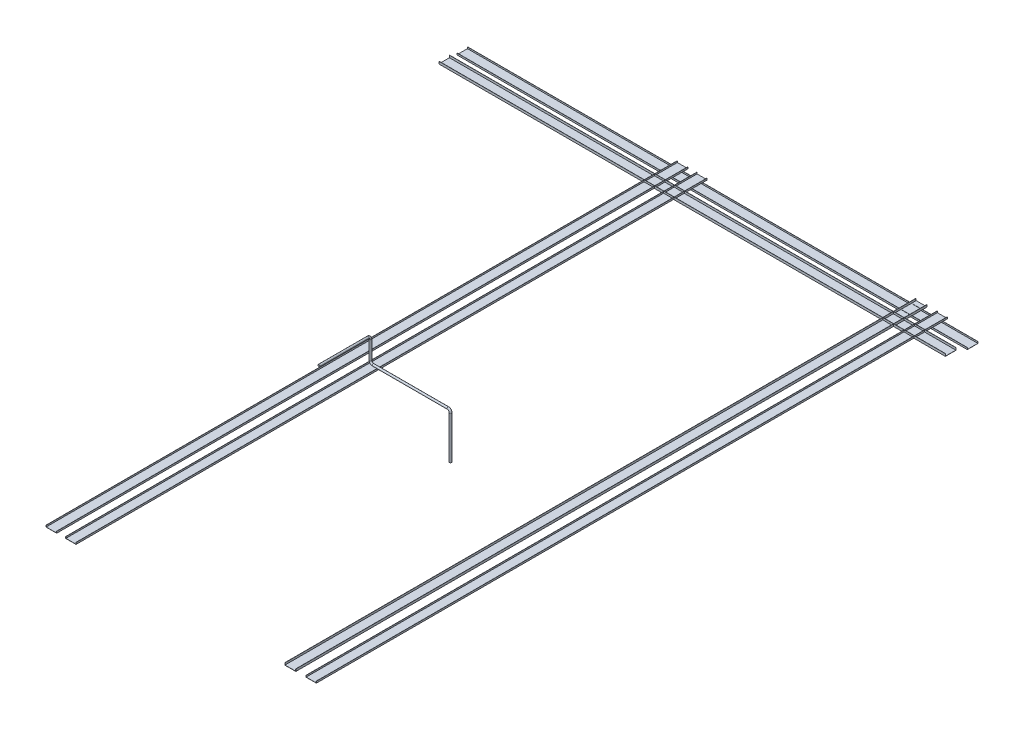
ISO-10303-21;
HEADER;
FILE_DESCRIPTION(('STEP AP214'),'2;1');
FILE_NAME('part.step','',(''),(''),'','','');
FILE_SCHEMA(('AUTOMOTIVE_DESIGN { 1 0 10303 214 1 1 1 1 }'));
ENDSEC;
DATA;
#1=APPLICATION_CONTEXT('core data for automotive mechanical design processes');
#2=APPLICATION_PROTOCOL_DEFINITION('international standard','automotive_design',2000,#1);
#3=PRODUCT_CONTEXT('',#1,'mechanical');
#4=PRODUCT('Part','Part','',(#3));
#5=PRODUCT_RELATED_PRODUCT_CATEGORY('part','',(#4));
#6=PRODUCT_DEFINITION_FORMATION('','',#4);
#7=PRODUCT_DEFINITION_CONTEXT('part definition',#1,'design');
#8=PRODUCT_DEFINITION('design','',#6,#7);
#9=PRODUCT_DEFINITION_SHAPE('','',#8);
#10=(LENGTH_UNIT() NAMED_UNIT(*) SI_UNIT(.MILLI.,.METRE.));
#11=(NAMED_UNIT(*) PLANE_ANGLE_UNIT() SI_UNIT($,.RADIAN.));
#12=(NAMED_UNIT(*) SI_UNIT($,.STERADIAN.) SOLID_ANGLE_UNIT());
#13=UNCERTAINTY_MEASURE_WITH_UNIT(LENGTH_MEASURE(1.E-05),#10,'distance_accuracy_value','');
#14=(GEOMETRIC_REPRESENTATION_CONTEXT(3) GLOBAL_UNCERTAINTY_ASSIGNED_CONTEXT((#13)) GLOBAL_UNIT_ASSIGNED_CONTEXT((#10,
#11,#12)) REPRESENTATION_CONTEXT('',''));
#15=CARTESIAN_POINT('',(0.,0.,0.));
#16=DIRECTION('',(0.,0.,1.));
#17=DIRECTION('',(1.,0.,0.));
#18=AXIS2_PLACEMENT_3D('',#15,#16,#17);
#19=CARTESIAN_POINT('',(29143.5,-655.,-18749.99));
#20=DIRECTION('',(0.,1.,0.));
#21=DIRECTION('',(0.,0.,1.));
#22=AXIS2_PLACEMENT_3D('',#19,#20,#21);
#23=PLANE('',#22);
#24=DIRECTION('',(1.,0.,0.));
#25=VECTOR('',#24,1.);
#26=CARTESIAN_POINT('',(37660.99,-655.,-18749.99));
#27=LINE('',#26,#25);
#28=CARTESIAN_POINT('',(29448.5,-655.,-18749.99));
#29=VERTEX_POINT('',#28);
#30=CARTESIAN_POINT('',(29148.5,-655.,-18749.99));
#31=VERTEX_POINT('',#30);
#32=EDGE_CURVE('P0_E98',#29,#31,#27,.F.);
#33=ORIENTED_EDGE('',*,*,#32,.F.);
#34=DIRECTION('',(0.,0.,1.));
#35=VECTOR('',#34,1.);
#36=CARTESIAN_POINT('',(29448.5,-655.,-18749.99));
#37=LINE('',#36,#35);
#38=CARTESIAN_POINT('',(29448.5,-655.,-37660.99));
#39=VERTEX_POINT('',#38);
#40=EDGE_CURVE('P0_E84',#39,#29,#37,.T.);
#41=ORIENTED_EDGE('',*,*,#40,.F.);
#42=DIRECTION('',(1.,0.,0.));
#43=VECTOR('',#42,1.);
#44=CARTESIAN_POINT('',(37660.99,-655.,-37660.99));
#45=LINE('',#44,#43);
#46=CARTESIAN_POINT('',(29148.5,-655.,-37660.99));
#47=VERTEX_POINT('',#46);
#48=EDGE_CURVE('P0_E121',#39,#47,#45,.F.);
#49=ORIENTED_EDGE('',*,*,#48,.T.);
#50=DIRECTION('',(0.,0.,-1.));
#51=VECTOR('',#50,1.);
#52=CARTESIAN_POINT('',(29148.5,-655.,-18749.99));
#53=LINE('',#52,#51);
#54=EDGE_CURVE('P0_E19',#31,#47,#53,.T.);
#55=ORIENTED_EDGE('',*,*,#54,.F.);
#56=EDGE_LOOP('',(#33,#41,#49,#55));
#57=FACE_BOUND('',#56,.T.);
#58=ADVANCED_FACE('P0_F16',(#57),#23,.T.);
#59=CARTESIAN_POINT('',(29148.5,-610.,-18749.99));
#60=DIRECTION('',(1.,0.,0.));
#61=DIRECTION('',(0.,0.,-1.));
#62=AXIS2_PLACEMENT_3D('',#59,#60,#61);
#63=PLANE('',#62);
#64=DIRECTION('',(0.,1.,0.));
#65=VECTOR('',#64,1.);
#66=CARTESIAN_POINT('',(29148.5,0.,-18749.99));
#67=LINE('',#66,#65);
#68=CARTESIAN_POINT('',(29148.5,-610.,-18749.99));
#69=VERTEX_POINT('',#68);
#70=EDGE_CURVE('P0_E104',#31,#69,#67,.T.);
#71=ORIENTED_EDGE('',*,*,#70,.F.);
#72=ORIENTED_EDGE('',*,*,#54,.T.);
#73=DIRECTION('',(0.,1.,0.));
#74=VECTOR('',#73,1.);
#75=CARTESIAN_POINT('',(29148.5,0.,-37660.99));
#76=LINE('',#75,#74);
#77=CARTESIAN_POINT('',(29148.5,-610.,-37660.99));
#78=VERTEX_POINT('',#77);
#79=EDGE_CURVE('P0_E118',#47,#78,#76,.T.);
#80=ORIENTED_EDGE('',*,*,#79,.T.);
#81=DIRECTION('',(0.,0.,-1.));
#82=VECTOR('',#81,1.);
#83=CARTESIAN_POINT('',(29148.5,-610.,-18749.99));
#84=LINE('',#83,#82);
#85=EDGE_CURVE('P0_E93',#78,#69,#84,.F.);
#86=ORIENTED_EDGE('',*,*,#85,.T.);
#87=EDGE_LOOP('',(#71,#72,#80,#86));
#88=FACE_BOUND('',#87,.T.);
#89=ADVANCED_FACE('P0_F117',(#88),#63,.T.);
#90=CARTESIAN_POINT('',(29148.5,-610.,-18749.99));
#91=DIRECTION('',(0.,-1.,0.));
#92=DIRECTION('',(0.,0.,-1.));
#93=AXIS2_PLACEMENT_3D('',#90,#91,#92);
#94=PLANE('',#93);
#95=DIRECTION('',(0.,0.,-1.));
#96=VECTOR('',#95,1.);
#97=CARTESIAN_POINT('',(29143.5,-610.,-18749.99));
#98=LINE('',#97,#96);
#99=CARTESIAN_POINT('',(29143.5,-610.,-37660.99));
#100=VERTEX_POINT('',#99);
#101=CARTESIAN_POINT('',(29143.5,-610.,-18749.99));
#102=VERTEX_POINT('',#101);
#103=EDGE_CURVE('P0_E101',#100,#102,#98,.F.);
#104=ORIENTED_EDGE('',*,*,#103,.T.);
#105=DIRECTION('',(1.,0.,0.));
#106=VECTOR('',#105,1.);
#107=CARTESIAN_POINT('',(37660.99,-610.,-18749.99));
#108=LINE('',#107,#106);
#109=EDGE_CURVE('P0_E106',#69,#102,#108,.F.);
#110=ORIENTED_EDGE('',*,*,#109,.F.);
#111=ORIENTED_EDGE('',*,*,#85,.F.);
#112=DIRECTION('',(1.,0.,0.));
#113=VECTOR('',#112,1.);
#114=CARTESIAN_POINT('',(37660.99,-610.,-37660.99));
#115=LINE('',#114,#113);
#116=EDGE_CURVE('P0_E124',#78,#100,#115,.F.);
#117=ORIENTED_EDGE('',*,*,#116,.T.);
#118=EDGE_LOOP('',(#104,#110,#111,#117));
#119=FACE_BOUND('',#118,.T.);
#120=ADVANCED_FACE('P0_F139',(#119),#94,.F.);
#121=CARTESIAN_POINT('',(29453.5,-610.,-18749.99));
#122=DIRECTION('',(0.,-1.,0.));
#123=DIRECTION('',(0.,0.,-1.));
#124=AXIS2_PLACEMENT_3D('',#121,#122,#123);
#125=PLANE('',#124);
#126=DIRECTION('',(0.,0.,1.));
#127=VECTOR('',#126,1.);
#128=CARTESIAN_POINT('',(29448.5,-610.,-18749.99));
#129=LINE('',#128,#127);
#130=CARTESIAN_POINT('',(29448.5,-610.,-18749.99));
#131=VERTEX_POINT('',#130);
#132=CARTESIAN_POINT('',(29448.5,-610.,-37660.99));
#133=VERTEX_POINT('',#132);
#134=EDGE_CURVE('P0_E77',#131,#133,#129,.F.);
#135=ORIENTED_EDGE('',*,*,#134,.F.);
#136=DIRECTION('',(1.,0.,0.));
#137=VECTOR('',#136,1.);
#138=CARTESIAN_POINT('',(37660.99,-610.,-18749.99));
#139=LINE('',#138,#137);
#140=CARTESIAN_POINT('',(29453.5,-610.,-18749.99));
#141=VERTEX_POINT('',#140);
#142=EDGE_CURVE('P0_E100',#141,#131,#139,.F.);
#143=ORIENTED_EDGE('',*,*,#142,.F.);
#144=DIRECTION('',(0.,0.,1.));
#145=VECTOR('',#144,1.);
#146=CARTESIAN_POINT('',(29453.5,-610.,-18749.99));
#147=LINE('',#146,#145);
#148=CARTESIAN_POINT('',(29453.5,-610.,-37660.99));
#149=VERTEX_POINT('',#148);
#150=EDGE_CURVE('P0_E126',#141,#149,#147,.F.);
#151=ORIENTED_EDGE('',*,*,#150,.T.);
#152=DIRECTION('',(1.,0.,0.));
#153=VECTOR('',#152,1.);
#154=CARTESIAN_POINT('',(37660.99,-610.,-37660.99));
#155=LINE('',#154,#153);
#156=EDGE_CURVE('P0_E150',#149,#133,#155,.F.);
#157=ORIENTED_EDGE('',*,*,#156,.T.);
#158=EDGE_LOOP('',(#135,#143,#151,#157));
#159=FACE_BOUND('',#158,.T.);
#160=ADVANCED_FACE('P0_F178',(#159),#125,.F.);
#161=CARTESIAN_POINT('',(29448.5,-660.,-18749.99));
#162=DIRECTION('',(-1.,0.,0.));
#163=DIRECTION('',(0.,0.,1.));
#164=AXIS2_PLACEMENT_3D('',#161,#162,#163);
#165=PLANE('',#164);
#166=DIRECTION('',(0.,1.,0.));
#167=VECTOR('',#166,1.);
#168=CARTESIAN_POINT('',(29448.5,0.,-18749.99));
#169=LINE('',#168,#167);
#170=EDGE_CURVE('P0_E87',#131,#29,#169,.F.);
#171=ORIENTED_EDGE('',*,*,#170,.F.);
#172=ORIENTED_EDGE('',*,*,#134,.T.);
#173=DIRECTION('',(0.,1.,0.));
#174=VECTOR('',#173,1.);
#175=CARTESIAN_POINT('',(29448.5,0.,-37660.99));
#176=LINE('',#175,#174);
#177=EDGE_CURVE('P0_E89',#133,#39,#176,.F.);
#178=ORIENTED_EDGE('',*,*,#177,.T.);
#179=ORIENTED_EDGE('',*,*,#40,.T.);
#180=EDGE_LOOP('',(#171,#172,#178,#179));
#181=FACE_BOUND('',#180,.T.);
#182=ADVANCED_FACE('P0_F86',(#181),#165,.T.);
#183=CARTESIAN_POINT('',(29143.5,-610.,-18749.99));
#184=DIRECTION('',(1.,0.,0.));
#185=DIRECTION('',(0.,0.,-1.));
#186=AXIS2_PLACEMENT_3D('',#183,#184,#185);
#187=PLANE('',#186);
#188=DIRECTION('',(0.,0.,1.));
#189=VECTOR('',#188,1.);
#190=CARTESIAN_POINT('',(29143.5,-660.,-18749.99));
#191=LINE('',#190,#189);
#192=CARTESIAN_POINT('',(29143.5,-660.,-37660.99));
#193=VERTEX_POINT('',#192);
#194=CARTESIAN_POINT('',(29143.5,-660.,-18749.99));
#195=VERTEX_POINT('',#194);
#196=EDGE_CURVE('P0_E144',#193,#195,#191,.T.);
#197=ORIENTED_EDGE('',*,*,#196,.T.);
#198=DIRECTION('',(0.,1.,0.));
#199=VECTOR('',#198,1.);
#200=CARTESIAN_POINT('',(29143.5,0.,-18749.99));
#201=LINE('',#200,#199);
#202=EDGE_CURVE('P0_E134',#102,#195,#201,.F.);
#203=ORIENTED_EDGE('',*,*,#202,.F.);
#204=ORIENTED_EDGE('',*,*,#103,.F.);
#205=DIRECTION('',(0.,1.,0.));
#206=VECTOR('',#205,1.);
#207=CARTESIAN_POINT('',(29143.5,0.,-37660.99));
#208=LINE('',#207,#206);
#209=EDGE_CURVE('P0_E145',#100,#193,#208,.F.);
#210=ORIENTED_EDGE('',*,*,#209,.T.);
#211=EDGE_LOOP('',(#197,#203,#204,#210));
#212=FACE_BOUND('',#211,.T.);
#213=ADVANCED_FACE('P0_F143',(#212),#187,.F.);
#214=CARTESIAN_POINT('',(37660.99,0.,-18749.99));
#215=DIRECTION('',(0.,0.,1.));
#216=DIRECTION('',(1.,0.,0.));
#217=AXIS2_PLACEMENT_3D('',#214,#215,#216);
#218=PLANE('',#217);
#219=DIRECTION('',(0.,1.,0.));
#220=VECTOR('',#219,1.);
#221=CARTESIAN_POINT('',(29453.5,-660.,-18749.99));
#222=LINE('',#221,#220);
#223=CARTESIAN_POINT('',(29453.5,-660.,-18749.99));
#224=VERTEX_POINT('',#223);
#225=EDGE_CURVE('P0_E128',#224,#141,#222,.T.);
#226=ORIENTED_EDGE('',*,*,#225,.T.);
#227=ORIENTED_EDGE('',*,*,#142,.T.);
#228=ORIENTED_EDGE('',*,*,#170,.T.);
#229=ORIENTED_EDGE('',*,*,#32,.T.);
#230=ORIENTED_EDGE('',*,*,#70,.T.);
#231=ORIENTED_EDGE('',*,*,#109,.T.);
#232=ORIENTED_EDGE('',*,*,#202,.T.);
#233=DIRECTION('',(1.,0.,0.));
#234=VECTOR('',#233,1.);
#235=CARTESIAN_POINT('',(29143.5,-660.,-18749.99));
#236=LINE('',#235,#234);
#237=EDGE_CURVE('P0_E147',#195,#224,#236,.T.);
#238=ORIENTED_EDGE('',*,*,#237,.T.);
#239=EDGE_LOOP('',(#226,#227,#228,#229,#230,#231,#232,#238));
#240=FACE_BOUND('',#239,.T.);
#241=ADVANCED_FACE('P0_F97',(#240),#218,.T.);
#242=CARTESIAN_POINT('',(29453.5,-660.,-18749.99));
#243=DIRECTION('',(-1.,0.,0.));
#244=DIRECTION('',(0.,0.,1.));
#245=AXIS2_PLACEMENT_3D('',#242,#243,#244);
#246=PLANE('',#245);
#247=ORIENTED_EDGE('',*,*,#150,.F.);
#248=ORIENTED_EDGE('',*,*,#225,.F.);
#249=DIRECTION('',(0.,0.,1.));
#250=VECTOR('',#249,1.);
#251=CARTESIAN_POINT('',(29453.5,-660.,-18749.99));
#252=LINE('',#251,#250);
#253=CARTESIAN_POINT('',(29453.5,-660.,-37660.99));
#254=VERTEX_POINT('',#253);
#255=EDGE_CURVE('P0_E25',#224,#254,#252,.F.);
#256=ORIENTED_EDGE('',*,*,#255,.T.);
#257=DIRECTION('',(0.,1.,0.));
#258=VECTOR('',#257,1.);
#259=CARTESIAN_POINT('',(29453.5,0.,-37660.99));
#260=LINE('',#259,#258);
#261=EDGE_CURVE('P0_E33',#254,#149,#260,.T.);
#262=ORIENTED_EDGE('',*,*,#261,.T.);
#263=EDGE_LOOP('',(#247,#248,#256,#262));
#264=FACE_BOUND('',#263,.T.);
#265=ADVANCED_FACE('P0_F159',(#264),#246,.F.);
#266=CARTESIAN_POINT('',(37660.99,0.,-37660.99));
#267=DIRECTION('',(0.,0.,1.));
#268=DIRECTION('',(1.,0.,0.));
#269=AXIS2_PLACEMENT_3D('',#266,#267,#268);
#270=PLANE('',#269);
#271=ORIENTED_EDGE('',*,*,#156,.F.);
#272=ORIENTED_EDGE('',*,*,#261,.F.);
#273=DIRECTION('',(1.,0.,0.));
#274=VECTOR('',#273,1.);
#275=CARTESIAN_POINT('',(29143.5,-660.,-37660.99));
#276=LINE('',#275,#274);
#277=EDGE_CURVE('P0_E11',#254,#193,#276,.F.);
#278=ORIENTED_EDGE('',*,*,#277,.T.);
#279=ORIENTED_EDGE('',*,*,#209,.F.);
#280=ORIENTED_EDGE('',*,*,#116,.F.);
#281=ORIENTED_EDGE('',*,*,#79,.F.);
#282=ORIENTED_EDGE('',*,*,#48,.F.);
#283=ORIENTED_EDGE('',*,*,#177,.F.);
#284=EDGE_LOOP('',(#271,#272,#278,#279,#280,#281,#282,#283));
#285=FACE_BOUND('',#284,.T.);
#286=ADVANCED_FACE('P0_F120',(#285),#270,.F.);
#287=CARTESIAN_POINT('',(29143.5,-660.,-18749.99));
#288=DIRECTION('',(0.,1.,0.));
#289=DIRECTION('',(0.,0.,1.));
#290=AXIS2_PLACEMENT_3D('',#287,#288,#289);
#291=PLANE('',#290);
#292=ORIENTED_EDGE('',*,*,#255,.F.);
#293=ORIENTED_EDGE('',*,*,#237,.F.);
#294=ORIENTED_EDGE('',*,*,#196,.F.);
#295=ORIENTED_EDGE('',*,*,#277,.F.);
#296=EDGE_LOOP('',(#292,#293,#294,#295));
#297=FACE_BOUND('',#296,.T.);
#298=ADVANCED_FACE('P0_F161',(#297),#291,.F.);
#299=CLOSED_SHELL('',(#58,#89,#120,#160,#182,#213,#241,#265,#286,#298));
#300=MANIFOLD_SOLID_BREP('P0_B1',#299);
#301=CARTESIAN_POINT('',(28838.5,-600.,-18749.99));
#302=DIRECTION('',(0.,-1.,0.));
#303=DIRECTION('',(0.,0.,-1.));
#304=AXIS2_PLACEMENT_3D('',#301,#302,#303);
#305=PLANE('',#304);
#306=DIRECTION('',(0.,0.,-1.));
#307=VECTOR('',#306,1.);
#308=CARTESIAN_POINT('',(28833.5,-600.,-18749.99));
#309=LINE('',#308,#307);
#310=CARTESIAN_POINT('',(28833.5,-600.,-37660.99));
#311=VERTEX_POINT('',#310);
#312=CARTESIAN_POINT('',(28833.5,-600.,-18749.99));
#313=VERTEX_POINT('',#312);
#314=EDGE_CURVE('P1_E19',#311,#313,#309,.F.);
#315=ORIENTED_EDGE('',*,*,#314,.T.);
#316=DIRECTION('',(1.,0.,0.));
#317=VECTOR('',#316,1.);
#318=CARTESIAN_POINT('',(37660.99,-600.,-18749.99));
#319=LINE('',#318,#317);
#320=CARTESIAN_POINT('',(28838.5,-600.,-18749.99));
#321=VERTEX_POINT('',#320);
#322=EDGE_CURVE('P1_E120',#321,#313,#319,.F.);
#323=ORIENTED_EDGE('',*,*,#322,.F.);
#324=DIRECTION('',(0.,0.,-1.));
#325=VECTOR('',#324,1.);
#326=CARTESIAN_POINT('',(28838.5,-600.,-18749.99));
#327=LINE('',#326,#325);
#328=CARTESIAN_POINT('',(28838.5,-600.,-37660.99));
#329=VERTEX_POINT('',#328);
#330=EDGE_CURVE('P1_E86',#329,#321,#327,.F.);
#331=ORIENTED_EDGE('',*,*,#330,.F.);
#332=DIRECTION('',(1.,0.,0.));
#333=VECTOR('',#332,1.);
#334=CARTESIAN_POINT('',(37660.99,-600.,-37660.99));
#335=LINE('',#334,#333);
#336=EDGE_CURVE('P1_E83',#329,#311,#335,.F.);
#337=ORIENTED_EDGE('',*,*,#336,.T.);
#338=EDGE_LOOP('',(#315,#323,#331,#337));
#339=FACE_BOUND('',#338,.T.);
#340=ADVANCED_FACE('P1_F16',(#339),#305,.F.);
#341=CARTESIAN_POINT('',(28833.5,-600.,-18749.99));
#342=DIRECTION('',(1.,0.,0.));
#343=DIRECTION('',(0.,0.,-1.));
#344=AXIS2_PLACEMENT_3D('',#341,#342,#343);
#345=PLANE('',#344);
#346=DIRECTION('',(0.,0.,-1.));
#347=VECTOR('',#346,1.);
#348=CARTESIAN_POINT('',(28833.5,-660.,-18749.99));
#349=LINE('',#348,#347);
#350=CARTESIAN_POINT('',(28833.5,-660.,-37660.99));
#351=VERTEX_POINT('',#350);
#352=CARTESIAN_POINT('',(28833.5,-660.,-18749.99));
#353=VERTEX_POINT('',#352);
#354=EDGE_CURVE('P1_E95',#351,#353,#349,.F.);
#355=ORIENTED_EDGE('',*,*,#354,.T.);
#356=DIRECTION('',(0.,1.,0.));
#357=VECTOR('',#356,1.);
#358=CARTESIAN_POINT('',(28833.5,0.,-18749.99));
#359=LINE('',#358,#357);
#360=EDGE_CURVE('P1_E93',#313,#353,#359,.F.);
#361=ORIENTED_EDGE('',*,*,#360,.F.);
#362=ORIENTED_EDGE('',*,*,#314,.F.);
#363=DIRECTION('',(0.,1.,0.));
#364=VECTOR('',#363,1.);
#365=CARTESIAN_POINT('',(28833.5,0.,-37660.99));
#366=LINE('',#365,#364);
#367=EDGE_CURVE('P1_E78',#311,#351,#366,.F.);
#368=ORIENTED_EDGE('',*,*,#367,.T.);
#369=EDGE_LOOP('',(#355,#361,#362,#368));
#370=FACE_BOUND('',#369,.T.);
#371=ADVANCED_FACE('P1_F91',(#370),#345,.F.);
#372=CARTESIAN_POINT('',(28833.5,-660.,-18749.99));
#373=DIRECTION('',(0.,-1.,0.));
#374=DIRECTION('',(0.,0.,-1.));
#375=AXIS2_PLACEMENT_3D('',#372,#373,#374);
#376=PLANE('',#375);
#377=DIRECTION('',(0.,0.,1.));
#378=VECTOR('',#377,1.);
#379=CARTESIAN_POINT('',(28513.5,-660.,-18749.99));
#380=LINE('',#379,#378);
#381=CARTESIAN_POINT('',(28513.5,-660.,-37660.99));
#382=VERTEX_POINT('',#381);
#383=CARTESIAN_POINT('',(28513.5,-660.,-18749.99));
#384=VERTEX_POINT('',#383);
#385=EDGE_CURVE('P1_E107',#382,#384,#380,.T.);
#386=ORIENTED_EDGE('',*,*,#385,.T.);
#387=DIRECTION('',(1.,0.,0.));
#388=VECTOR('',#387,1.);
#389=CARTESIAN_POINT('',(37660.99,-660.,-18749.99));
#390=LINE('',#389,#388);
#391=EDGE_CURVE('P1_E111',#353,#384,#390,.F.);
#392=ORIENTED_EDGE('',*,*,#391,.F.);
#393=ORIENTED_EDGE('',*,*,#354,.F.);
#394=DIRECTION('',(1.,0.,0.));
#395=VECTOR('',#394,1.);
#396=CARTESIAN_POINT('',(37660.99,-660.,-37660.99));
#397=LINE('',#396,#395);
#398=EDGE_CURVE('P1_E100',#351,#382,#397,.F.);
#399=ORIENTED_EDGE('',*,*,#398,.T.);
#400=EDGE_LOOP('',(#386,#392,#393,#399));
#401=FACE_BOUND('',#400,.T.);
#402=ADVANCED_FACE('P1_F112',(#401),#376,.F.);
#403=CARTESIAN_POINT('',(28513.5,-660.,-18749.99));
#404=DIRECTION('',(-1.,1.1842378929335E-13,0.));
#405=DIRECTION('',(-1.1842378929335E-13,-1.,0.));
#406=AXIS2_PLACEMENT_3D('',#403,#404,#405);
#407=PLANE('',#406);
#408=DIRECTION('',(0.,0.,1.));
#409=VECTOR('',#408,1.);
#410=CARTESIAN_POINT('',(28513.5,-600.,-18749.99));
#411=LINE('',#410,#409);
#412=CARTESIAN_POINT('',(28513.5,-600.,-37660.99));
#413=VERTEX_POINT('',#412);
#414=CARTESIAN_POINT('',(28513.5,-600.,-18749.99));
#415=VERTEX_POINT('',#414);
#416=EDGE_CURVE('P1_E89',#413,#415,#411,.T.);
#417=ORIENTED_EDGE('',*,*,#416,.T.);
#418=DIRECTION('',(0.,1.,0.));
#419=VECTOR('',#418,1.);
#420=CARTESIAN_POINT('',(28513.5,0.,-18749.99));
#421=LINE('',#420,#419);
#422=EDGE_CURVE('P1_E116',#384,#415,#421,.T.);
#423=ORIENTED_EDGE('',*,*,#422,.F.);
#424=ORIENTED_EDGE('',*,*,#385,.F.);
#425=DIRECTION('',(0.,1.,0.));
#426=VECTOR('',#425,1.);
#427=CARTESIAN_POINT('',(28513.5,0.,-37660.99));
#428=LINE('',#427,#426);
#429=EDGE_CURVE('P1_E102',#382,#413,#428,.T.);
#430=ORIENTED_EDGE('',*,*,#429,.T.);
#431=EDGE_LOOP('',(#417,#423,#424,#430));
#432=FACE_BOUND('',#431,.T.);
#433=ADVANCED_FACE('P1_F133',(#432),#407,.F.);
#434=CARTESIAN_POINT('',(28513.5,-600.,-18749.99));
#435=DIRECTION('',(-1.11022302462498E-13,-1.,0.));
#436=DIRECTION('',(1.,-1.11022302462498E-13,0.));
#437=AXIS2_PLACEMENT_3D('',#434,#435,#436);
#438=PLANE('',#437);
#439=DIRECTION('',(0.,0.,1.));
#440=VECTOR('',#439,1.);
#441=CARTESIAN_POINT('',(28508.5,-599.999999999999,-18749.99));
#442=LINE('',#441,#440);
#443=CARTESIAN_POINT('',(28508.5,-600.,-18749.99));
#444=VERTEX_POINT('',#443);
#445=CARTESIAN_POINT('',(28508.5,-600.,-37660.99));
#446=VERTEX_POINT('',#445);
#447=EDGE_CURVE('P1_E147',#444,#446,#442,.F.);
#448=ORIENTED_EDGE('',*,*,#447,.F.);
#449=DIRECTION('',(1.,0.,0.));
#450=VECTOR('',#449,1.);
#451=CARTESIAN_POINT('',(37660.99,-600.,-18749.99));
#452=LINE('',#451,#450);
#453=EDGE_CURVE('P1_E139',#415,#444,#452,.F.);
#454=ORIENTED_EDGE('',*,*,#453,.F.);
#455=ORIENTED_EDGE('',*,*,#416,.F.);
#456=DIRECTION('',(1.,0.,0.));
#457=VECTOR('',#456,1.);
#458=CARTESIAN_POINT('',(37660.99,-600.,-37660.99));
#459=LINE('',#458,#457);
#460=EDGE_CURVE('P1_E130',#413,#446,#459,.F.);
#461=ORIENTED_EDGE('',*,*,#460,.T.);
#462=EDGE_LOOP('',(#448,#454,#455,#461));
#463=FACE_BOUND('',#462,.T.);
#464=ADVANCED_FACE('P1_F137',(#463),#438,.F.);
#465=CARTESIAN_POINT('',(37660.99,0.,-37660.99));
#466=DIRECTION('',(0.,0.,1.));
#467=DIRECTION('',(1.,0.,0.));
#468=AXIS2_PLACEMENT_3D('',#465,#466,#467);
#469=PLANE('',#468);
#470=ORIENTED_EDGE('',*,*,#460,.F.);
#471=ORIENTED_EDGE('',*,*,#429,.F.);
#472=ORIENTED_EDGE('',*,*,#398,.F.);
#473=ORIENTED_EDGE('',*,*,#367,.F.);
#474=ORIENTED_EDGE('',*,*,#336,.F.);
#475=DIRECTION('',(0.,1.,0.));
#476=VECTOR('',#475,1.);
#477=CARTESIAN_POINT('',(28838.5,-600.,-37660.99));
#478=LINE('',#477,#476);
#479=CARTESIAN_POINT('',(28838.5,-665.,-37660.99));
#480=VERTEX_POINT('',#479);
#481=EDGE_CURVE('P1_E128',#480,#329,#478,.T.);
#482=ORIENTED_EDGE('',*,*,#481,.F.);
#483=DIRECTION('',(1.,0.,0.));
#484=VECTOR('',#483,1.);
#485=CARTESIAN_POINT('',(28833.5,-665.,-37660.99));
#486=LINE('',#485,#484);
#487=CARTESIAN_POINT('',(28508.5,-665.,-37660.99));
#488=VERTEX_POINT('',#487);
#489=EDGE_CURVE('P1_E144',#488,#480,#486,.T.);
#490=ORIENTED_EDGE('',*,*,#489,.F.);
#491=DIRECTION('',(-1.1842378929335E-13,-1.,0.));
#492=VECTOR('',#491,1.);
#493=CARTESIAN_POINT('',(28508.5,-659.999999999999,-37660.99));
#494=LINE('',#493,#492);
#495=EDGE_CURVE('P1_E141',#446,#488,#494,.T.);
#496=ORIENTED_EDGE('',*,*,#495,.F.);
#497=EDGE_LOOP('',(#470,#471,#472,#473,#474,#482,#490,#496));
#498=FACE_BOUND('',#497,.T.);
#499=ADVANCED_FACE('P1_F98',(#498),#469,.F.);
#500=CARTESIAN_POINT('',(28838.5,-600.,-18749.99));
#501=DIRECTION('',(1.,0.,0.));
#502=DIRECTION('',(0.,0.,-1.));
#503=AXIS2_PLACEMENT_3D('',#500,#501,#502);
#504=PLANE('',#503);
#505=DIRECTION('',(0.,1.,0.));
#506=VECTOR('',#505,1.);
#507=CARTESIAN_POINT('',(28838.5,0.,-18749.99));
#508=LINE('',#507,#506);
#509=CARTESIAN_POINT('',(28838.5,-665.,-18749.99));
#510=VERTEX_POINT('',#509);
#511=EDGE_CURVE('P1_E122',#510,#321,#508,.T.);
#512=ORIENTED_EDGE('',*,*,#511,.F.);
#513=DIRECTION('',(0.,0.,-1.));
#514=VECTOR('',#513,1.);
#515=CARTESIAN_POINT('',(28838.5,-665.,-18749.99));
#516=LINE('',#515,#514);
#517=EDGE_CURVE('P1_E150',#480,#510,#516,.F.);
#518=ORIENTED_EDGE('',*,*,#517,.F.);
#519=ORIENTED_EDGE('',*,*,#481,.T.);
#520=ORIENTED_EDGE('',*,*,#330,.T.);
#521=EDGE_LOOP('',(#512,#518,#519,#520));
#522=FACE_BOUND('',#521,.T.);
#523=ADVANCED_FACE('P1_F162',(#522),#504,.T.);
#524=CARTESIAN_POINT('',(37660.99,0.,-18749.99));
#525=DIRECTION('',(0.,0.,1.));
#526=DIRECTION('',(1.,0.,0.));
#527=AXIS2_PLACEMENT_3D('',#524,#525,#526);
#528=PLANE('',#527);
#529=ORIENTED_EDGE('',*,*,#422,.T.);
#530=ORIENTED_EDGE('',*,*,#453,.T.);
#531=DIRECTION('',(-1.1842378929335E-13,-1.,0.));
#532=VECTOR('',#531,1.);
#533=CARTESIAN_POINT('',(28508.5,-659.999999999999,-18749.99));
#534=LINE('',#533,#532);
#535=CARTESIAN_POINT('',(28508.5,-665.,-18749.99));
#536=VERTEX_POINT('',#535);
#537=EDGE_CURVE('P1_E34',#536,#444,#534,.F.);
#538=ORIENTED_EDGE('',*,*,#537,.F.);
#539=DIRECTION('',(1.,0.,0.));
#540=VECTOR('',#539,1.);
#541=CARTESIAN_POINT('',(28833.5,-665.,-18749.99));
#542=LINE('',#541,#540);
#543=EDGE_CURVE('P1_E25',#510,#536,#542,.F.);
#544=ORIENTED_EDGE('',*,*,#543,.F.);
#545=ORIENTED_EDGE('',*,*,#511,.T.);
#546=ORIENTED_EDGE('',*,*,#322,.T.);
#547=ORIENTED_EDGE('',*,*,#360,.T.);
#548=ORIENTED_EDGE('',*,*,#391,.T.);
#549=EDGE_LOOP('',(#529,#530,#538,#544,#545,#546,#547,#548));
#550=FACE_BOUND('',#549,.T.);
#551=ADVANCED_FACE('P1_F118',(#550),#528,.T.);
#552=CARTESIAN_POINT('',(28508.5,-659.999999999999,-18749.99));
#553=DIRECTION('',(-1.,1.1842378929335E-13,0.));
#554=DIRECTION('',(-1.1842378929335E-13,-1.,0.));
#555=AXIS2_PLACEMENT_3D('',#552,#553,#554);
#556=PLANE('',#555);
#557=ORIENTED_EDGE('',*,*,#537,.T.);
#558=ORIENTED_EDGE('',*,*,#447,.T.);
#559=ORIENTED_EDGE('',*,*,#495,.T.);
#560=DIRECTION('',(0.,0.,-1.));
#561=VECTOR('',#560,1.);
#562=CARTESIAN_POINT('',(28508.5,-665.,-18749.99));
#563=LINE('',#562,#561);
#564=EDGE_CURVE('P1_E11',#536,#488,#563,.T.);
#565=ORIENTED_EDGE('',*,*,#564,.F.);
#566=EDGE_LOOP('',(#557,#558,#559,#565));
#567=FACE_BOUND('',#566,.T.);
#568=ADVANCED_FACE('P1_F148',(#567),#556,.T.);
#569=CARTESIAN_POINT('',(28833.5,-665.,-18749.99));
#570=DIRECTION('',(0.,-1.,0.));
#571=DIRECTION('',(0.,0.,-1.));
#572=AXIS2_PLACEMENT_3D('',#569,#570,#571);
#573=PLANE('',#572);
#574=ORIENTED_EDGE('',*,*,#543,.T.);
#575=ORIENTED_EDGE('',*,*,#564,.T.);
#576=ORIENTED_EDGE('',*,*,#489,.T.);
#577=ORIENTED_EDGE('',*,*,#517,.T.);
#578=EDGE_LOOP('',(#574,#575,#576,#577));
#579=FACE_BOUND('',#578,.T.);
#580=ADVANCED_FACE('P1_F159',(#579),#573,.T.);
#581=CLOSED_SHELL('',(#340,#371,#402,#433,#464,#499,#523,#551,#568,#580));
#582=MANIFOLD_SOLID_BREP('P1_B1',#581);
#583=CARTESIAN_POINT('',(21353.5,-655.,-18749.99));
#584=DIRECTION('',(0.,1.,0.));
#585=DIRECTION('',(0.,0.,1.));
#586=AXIS2_PLACEMENT_3D('',#583,#584,#585);
#587=PLANE('',#586);
#588=DIRECTION('',(1.,0.,0.));
#589=VECTOR('',#588,1.);
#590=CARTESIAN_POINT('',(37660.99,-655.,-18749.99));
#591=LINE('',#590,#589);
#592=CARTESIAN_POINT('',(21668.5,-655.,-18749.99));
#593=VERTEX_POINT('',#592);
#594=CARTESIAN_POINT('',(21358.5,-655.,-18749.99));
#595=VERTEX_POINT('',#594);
#596=EDGE_CURVE('P2_E98',#593,#595,#591,.F.);
#597=ORIENTED_EDGE('',*,*,#596,.F.);
#598=DIRECTION('',(0.,0.,1.));
#599=VECTOR('',#598,1.);
#600=CARTESIAN_POINT('',(21668.5,-655.,-18749.99));
#601=LINE('',#600,#599);
#602=CARTESIAN_POINT('',(21668.5,-655.,-37660.99));
#603=VERTEX_POINT('',#602);
#604=EDGE_CURVE('P2_E84',#603,#593,#601,.T.);
#605=ORIENTED_EDGE('',*,*,#604,.F.);
#606=DIRECTION('',(1.,0.,0.));
#607=VECTOR('',#606,1.);
#608=CARTESIAN_POINT('',(37660.99,-655.,-37660.99));
#609=LINE('',#608,#607);
#610=CARTESIAN_POINT('',(21358.5,-655.,-37660.99));
#611=VERTEX_POINT('',#610);
#612=EDGE_CURVE('P2_E121',#603,#611,#609,.F.);
#613=ORIENTED_EDGE('',*,*,#612,.T.);
#614=DIRECTION('',(0.,0.,1.));
#615=VECTOR('',#614,1.);
#616=CARTESIAN_POINT('',(21358.5,-655.,-18749.99));
#617=LINE('',#616,#615);
#618=EDGE_CURVE('P2_E19',#595,#611,#617,.F.);
#619=ORIENTED_EDGE('',*,*,#618,.F.);
#620=EDGE_LOOP('',(#597,#605,#613,#619));
#621=FACE_BOUND('',#620,.T.);
#622=ADVANCED_FACE('P2_F16',(#621),#587,.T.);
#623=CARTESIAN_POINT('',(21358.5,-610.,-18749.99));
#624=DIRECTION('',(1.,0.,0.));
#625=DIRECTION('',(0.,1.,0.));
#626=AXIS2_PLACEMENT_3D('',#623,#624,#625);
#627=PLANE('',#626);
#628=DIRECTION('',(0.,1.,0.));
#629=VECTOR('',#628,1.);
#630=CARTESIAN_POINT('',(21358.5,0.,-18749.99));
#631=LINE('',#630,#629);
#632=CARTESIAN_POINT('',(21358.5,-610.,-18749.99));
#633=VERTEX_POINT('',#632);
#634=EDGE_CURVE('P2_E104',#595,#633,#631,.T.);
#635=ORIENTED_EDGE('',*,*,#634,.F.);
#636=ORIENTED_EDGE('',*,*,#618,.T.);
#637=DIRECTION('',(0.,1.,0.));
#638=VECTOR('',#637,1.);
#639=CARTESIAN_POINT('',(21358.5,0.,-37660.99));
#640=LINE('',#639,#638);
#641=CARTESIAN_POINT('',(21358.5,-610.,-37660.99));
#642=VERTEX_POINT('',#641);
#643=EDGE_CURVE('P2_E118',#611,#642,#640,.T.);
#644=ORIENTED_EDGE('',*,*,#643,.T.);
#645=DIRECTION('',(0.,0.,1.));
#646=VECTOR('',#645,1.);
#647=CARTESIAN_POINT('',(21358.5,-610.,-18749.99));
#648=LINE('',#647,#646);
#649=EDGE_CURVE('P2_E93',#642,#633,#648,.T.);
#650=ORIENTED_EDGE('',*,*,#649,.T.);
#651=EDGE_LOOP('',(#635,#636,#644,#650));
#652=FACE_BOUND('',#651,.T.);
#653=ADVANCED_FACE('P2_F117',(#652),#627,.T.);
#654=CARTESIAN_POINT('',(21358.5,-610.,-18749.99));
#655=DIRECTION('',(0.,-1.,0.));
#656=DIRECTION('',(1.,0.,0.));
#657=AXIS2_PLACEMENT_3D('',#654,#655,#656);
#658=PLANE('',#657);
#659=DIRECTION('',(0.,0.,1.));
#660=VECTOR('',#659,1.);
#661=CARTESIAN_POINT('',(21353.5,-610.,-18749.99));
#662=LINE('',#661,#660);
#663=CARTESIAN_POINT('',(21353.5,-610.,-37660.99));
#664=VERTEX_POINT('',#663);
#665=CARTESIAN_POINT('',(21353.5,-610.,-18749.99));
#666=VERTEX_POINT('',#665);
#667=EDGE_CURVE('P2_E101',#664,#666,#662,.T.);
#668=ORIENTED_EDGE('',*,*,#667,.T.);
#669=DIRECTION('',(1.,0.,0.));
#670=VECTOR('',#669,1.);
#671=CARTESIAN_POINT('',(37660.99,-610.,-18749.99));
#672=LINE('',#671,#670);
#673=EDGE_CURVE('P2_E106',#633,#666,#672,.F.);
#674=ORIENTED_EDGE('',*,*,#673,.F.);
#675=ORIENTED_EDGE('',*,*,#649,.F.);
#676=DIRECTION('',(1.,0.,0.));
#677=VECTOR('',#676,1.);
#678=CARTESIAN_POINT('',(37660.99,-610.,-37660.99));
#679=LINE('',#678,#677);
#680=EDGE_CURVE('P2_E124',#642,#664,#679,.F.);
#681=ORIENTED_EDGE('',*,*,#680,.T.);
#682=EDGE_LOOP('',(#668,#674,#675,#681));
#683=FACE_BOUND('',#682,.T.);
#684=ADVANCED_FACE('P2_F139',(#683),#658,.F.);
#685=CARTESIAN_POINT('',(21673.5,-610.,-18749.99));
#686=DIRECTION('',(0.,-1.,0.));
#687=DIRECTION('',(0.,0.,-1.));
#688=AXIS2_PLACEMENT_3D('',#685,#686,#687);
#689=PLANE('',#688);
#690=DIRECTION('',(0.,0.,1.));
#691=VECTOR('',#690,1.);
#692=CARTESIAN_POINT('',(21668.5,-610.,-18749.99));
#693=LINE('',#692,#691);
#694=CARTESIAN_POINT('',(21668.5,-610.,-18749.99));
#695=VERTEX_POINT('',#694);
#696=CARTESIAN_POINT('',(21668.5,-610.,-37660.99));
#697=VERTEX_POINT('',#696);
#698=EDGE_CURVE('P2_E77',#695,#697,#693,.F.);
#699=ORIENTED_EDGE('',*,*,#698,.F.);
#700=DIRECTION('',(1.,0.,0.));
#701=VECTOR('',#700,1.);
#702=CARTESIAN_POINT('',(37660.99,-610.,-18749.99));
#703=LINE('',#702,#701);
#704=CARTESIAN_POINT('',(21673.5,-610.,-18749.99));
#705=VERTEX_POINT('',#704);
#706=EDGE_CURVE('P2_E100',#705,#695,#703,.F.);
#707=ORIENTED_EDGE('',*,*,#706,.F.);
#708=DIRECTION('',(0.,0.,1.));
#709=VECTOR('',#708,1.);
#710=CARTESIAN_POINT('',(21673.5,-610.,-18749.99));
#711=LINE('',#710,#709);
#712=CARTESIAN_POINT('',(21673.5,-610.,-37660.99));
#713=VERTEX_POINT('',#712);
#714=EDGE_CURVE('P2_E126',#705,#713,#711,.F.);
#715=ORIENTED_EDGE('',*,*,#714,.T.);
#716=DIRECTION('',(1.,0.,0.));
#717=VECTOR('',#716,1.);
#718=CARTESIAN_POINT('',(37660.99,-610.,-37660.99));
#719=LINE('',#718,#717);
#720=EDGE_CURVE('P2_E150',#713,#697,#719,.F.);
#721=ORIENTED_EDGE('',*,*,#720,.T.);
#722=EDGE_LOOP('',(#699,#707,#715,#721));
#723=FACE_BOUND('',#722,.T.);
#724=ADVANCED_FACE('P2_F178',(#723),#689,.F.);
#725=CARTESIAN_POINT('',(21668.5,-660.,-18749.99));
#726=DIRECTION('',(-1.,0.,0.));
#727=DIRECTION('',(0.,0.,1.));
#728=AXIS2_PLACEMENT_3D('',#725,#726,#727);
#729=PLANE('',#728);
#730=DIRECTION('',(0.,1.,0.));
#731=VECTOR('',#730,1.);
#732=CARTESIAN_POINT('',(21668.5,0.,-18749.99));
#733=LINE('',#732,#731);
#734=EDGE_CURVE('P2_E87',#695,#593,#733,.F.);
#735=ORIENTED_EDGE('',*,*,#734,.F.);
#736=ORIENTED_EDGE('',*,*,#698,.T.);
#737=DIRECTION('',(0.,1.,0.));
#738=VECTOR('',#737,1.);
#739=CARTESIAN_POINT('',(21668.5,0.,-37660.99));
#740=LINE('',#739,#738);
#741=EDGE_CURVE('P2_E89',#697,#603,#740,.F.);
#742=ORIENTED_EDGE('',*,*,#741,.T.);
#743=ORIENTED_EDGE('',*,*,#604,.T.);
#744=EDGE_LOOP('',(#735,#736,#742,#743));
#745=FACE_BOUND('',#744,.T.);
#746=ADVANCED_FACE('P2_F86',(#745),#729,.T.);
#747=CARTESIAN_POINT('',(21353.5,-610.,-18749.99));
#748=DIRECTION('',(1.,0.,0.));
#749=DIRECTION('',(0.,1.,0.));
#750=AXIS2_PLACEMENT_3D('',#747,#748,#749);
#751=PLANE('',#750);
#752=DIRECTION('',(0.,0.,1.));
#753=VECTOR('',#752,1.);
#754=CARTESIAN_POINT('',(21353.5,-660.,-18749.99));
#755=LINE('',#754,#753);
#756=CARTESIAN_POINT('',(21353.5,-660.,-37660.99));
#757=VERTEX_POINT('',#756);
#758=CARTESIAN_POINT('',(21353.5,-660.,-18749.99));
#759=VERTEX_POINT('',#758);
#760=EDGE_CURVE('P2_E144',#757,#759,#755,.T.);
#761=ORIENTED_EDGE('',*,*,#760,.T.);
#762=DIRECTION('',(0.,1.,0.));
#763=VECTOR('',#762,1.);
#764=CARTESIAN_POINT('',(21353.5,0.,-18749.99));
#765=LINE('',#764,#763);
#766=EDGE_CURVE('P2_E134',#666,#759,#765,.F.);
#767=ORIENTED_EDGE('',*,*,#766,.F.);
#768=ORIENTED_EDGE('',*,*,#667,.F.);
#769=DIRECTION('',(0.,1.,0.));
#770=VECTOR('',#769,1.);
#771=CARTESIAN_POINT('',(21353.5,0.,-37660.99));
#772=LINE('',#771,#770);
#773=EDGE_CURVE('P2_E145',#664,#757,#772,.F.);
#774=ORIENTED_EDGE('',*,*,#773,.T.);
#775=EDGE_LOOP('',(#761,#767,#768,#774));
#776=FACE_BOUND('',#775,.T.);
#777=ADVANCED_FACE('P2_F143',(#776),#751,.F.);
#778=CARTESIAN_POINT('',(37660.99,0.,-18749.99));
#779=DIRECTION('',(0.,0.,1.));
#780=DIRECTION('',(1.,0.,0.));
#781=AXIS2_PLACEMENT_3D('',#778,#779,#780);
#782=PLANE('',#781);
#783=DIRECTION('',(0.,1.,0.));
#784=VECTOR('',#783,1.);
#785=CARTESIAN_POINT('',(21673.5,-660.,-18749.99));
#786=LINE('',#785,#784);
#787=CARTESIAN_POINT('',(21673.5,-660.,-18749.99));
#788=VERTEX_POINT('',#787);
#789=EDGE_CURVE('P2_E128',#788,#705,#786,.T.);
#790=ORIENTED_EDGE('',*,*,#789,.T.);
#791=ORIENTED_EDGE('',*,*,#706,.T.);
#792=ORIENTED_EDGE('',*,*,#734,.T.);
#793=ORIENTED_EDGE('',*,*,#596,.T.);
#794=ORIENTED_EDGE('',*,*,#634,.T.);
#795=ORIENTED_EDGE('',*,*,#673,.T.);
#796=ORIENTED_EDGE('',*,*,#766,.T.);
#797=DIRECTION('',(1.,0.,0.));
#798=VECTOR('',#797,1.);
#799=CARTESIAN_POINT('',(21353.5,-660.,-18749.99));
#800=LINE('',#799,#798);
#801=EDGE_CURVE('P2_E147',#759,#788,#800,.T.);
#802=ORIENTED_EDGE('',*,*,#801,.T.);
#803=EDGE_LOOP('',(#790,#791,#792,#793,#794,#795,#796,#802));
#804=FACE_BOUND('',#803,.T.);
#805=ADVANCED_FACE('P2_F97',(#804),#782,.T.);
#806=CARTESIAN_POINT('',(21673.5,-660.,-18749.99));
#807=DIRECTION('',(-1.,0.,0.));
#808=DIRECTION('',(0.,0.,1.));
#809=AXIS2_PLACEMENT_3D('',#806,#807,#808);
#810=PLANE('',#809);
#811=ORIENTED_EDGE('',*,*,#714,.F.);
#812=ORIENTED_EDGE('',*,*,#789,.F.);
#813=DIRECTION('',(0.,0.,1.));
#814=VECTOR('',#813,1.);
#815=CARTESIAN_POINT('',(21673.5,-660.,-18749.99));
#816=LINE('',#815,#814);
#817=CARTESIAN_POINT('',(21673.5,-660.,-37660.99));
#818=VERTEX_POINT('',#817);
#819=EDGE_CURVE('P2_E25',#788,#818,#816,.F.);
#820=ORIENTED_EDGE('',*,*,#819,.T.);
#821=DIRECTION('',(0.,1.,0.));
#822=VECTOR('',#821,1.);
#823=CARTESIAN_POINT('',(21673.5,0.,-37660.99));
#824=LINE('',#823,#822);
#825=EDGE_CURVE('P2_E33',#818,#713,#824,.T.);
#826=ORIENTED_EDGE('',*,*,#825,.T.);
#827=EDGE_LOOP('',(#811,#812,#820,#826));
#828=FACE_BOUND('',#827,.T.);
#829=ADVANCED_FACE('P2_F159',(#828),#810,.F.);
#830=CARTESIAN_POINT('',(37660.99,0.,-37660.99));
#831=DIRECTION('',(0.,0.,1.));
#832=DIRECTION('',(1.,0.,0.));
#833=AXIS2_PLACEMENT_3D('',#830,#831,#832);
#834=PLANE('',#833);
#835=ORIENTED_EDGE('',*,*,#720,.F.);
#836=ORIENTED_EDGE('',*,*,#825,.F.);
#837=DIRECTION('',(1.,0.,0.));
#838=VECTOR('',#837,1.);
#839=CARTESIAN_POINT('',(21353.5,-660.,-37660.99));
#840=LINE('',#839,#838);
#841=EDGE_CURVE('P2_E11',#818,#757,#840,.F.);
#842=ORIENTED_EDGE('',*,*,#841,.T.);
#843=ORIENTED_EDGE('',*,*,#773,.F.);
#844=ORIENTED_EDGE('',*,*,#680,.F.);
#845=ORIENTED_EDGE('',*,*,#643,.F.);
#846=ORIENTED_EDGE('',*,*,#612,.F.);
#847=ORIENTED_EDGE('',*,*,#741,.F.);
#848=EDGE_LOOP('',(#835,#836,#842,#843,#844,#845,#846,#847));
#849=FACE_BOUND('',#848,.T.);
#850=ADVANCED_FACE('P2_F120',(#849),#834,.F.);
#851=CARTESIAN_POINT('',(21353.5,-660.,-18749.99));
#852=DIRECTION('',(0.,1.,0.));
#853=DIRECTION('',(0.,0.,1.));
#854=AXIS2_PLACEMENT_3D('',#851,#852,#853);
#855=PLANE('',#854);
#856=ORIENTED_EDGE('',*,*,#819,.F.);
#857=ORIENTED_EDGE('',*,*,#801,.F.);
#858=ORIENTED_EDGE('',*,*,#760,.F.);
#859=ORIENTED_EDGE('',*,*,#841,.F.);
#860=EDGE_LOOP('',(#856,#857,#858,#859));
#861=FACE_BOUND('',#860,.T.);
#862=ADVANCED_FACE('P2_F161',(#861),#855,.F.);
#863=CLOSED_SHELL('',(#622,#653,#684,#724,#746,#777,#805,#829,#850,#862));
#864=MANIFOLD_SOLID_BREP('P2_B1',#863);
#865=CARTESIAN_POINT('',(30505.5,-655.,-37520.99));
#866=DIRECTION('',(0.,-1.,0.));
#867=DIRECTION('',(0.,0.,-1.));
#868=AXIS2_PLACEMENT_3D('',#865,#866,#867);
#869=PLANE('',#868);
#870=DIRECTION('',(-1.,0.,0.));
#871=VECTOR('',#870,1.);
#872=CARTESIAN_POINT('',(30505.5,-655.,-37515.99));
#873=LINE('',#872,#871);
#874=CARTESIAN_POINT('',(15213.5,-655.,-37515.99));
#875=VERTEX_POINT('',#874);
#876=CARTESIAN_POINT('',(30505.5,-655.,-37515.99));
#877=VERTEX_POINT('',#876);
#878=EDGE_CURVE('P3_E19',#875,#877,#873,.F.);
#879=ORIENTED_EDGE('',*,*,#878,.T.);
#880=DIRECTION('',(0.,0.,-1.));
#881=VECTOR('',#880,1.);
#882=CARTESIAN_POINT('',(30505.5,-655.,-15213.5));
#883=LINE('',#882,#881);
#884=CARTESIAN_POINT('',(30505.5,-655.,-37520.99));
#885=VERTEX_POINT('',#884);
#886=EDGE_CURVE('P3_E120',#885,#877,#883,.F.);
#887=ORIENTED_EDGE('',*,*,#886,.F.);
#888=DIRECTION('',(-1.,0.,0.));
#889=VECTOR('',#888,1.);
#890=CARTESIAN_POINT('',(30505.5,-655.,-37520.99));
#891=LINE('',#890,#889);
#892=CARTESIAN_POINT('',(15213.5,-655.,-37520.99));
#893=VERTEX_POINT('',#892);
#894=EDGE_CURVE('P3_E86',#893,#885,#891,.F.);
#895=ORIENTED_EDGE('',*,*,#894,.F.);
#896=DIRECTION('',(0.,0.,-1.));
#897=VECTOR('',#896,1.);
#898=CARTESIAN_POINT('',(15213.5,-655.,-15213.5));
#899=LINE('',#898,#897);
#900=EDGE_CURVE('P3_E83',#893,#875,#899,.F.);
#901=ORIENTED_EDGE('',*,*,#900,.T.);
#902=EDGE_LOOP('',(#879,#887,#895,#901));
#903=FACE_BOUND('',#902,.T.);
#904=ADVANCED_FACE('P3_F16',(#903),#869,.F.);
#905=CARTESIAN_POINT('',(30505.5,-655.,-37515.99));
#906=DIRECTION('',(0.,0.,-1.));
#907=DIRECTION('',(-1.,0.,0.));
#908=AXIS2_PLACEMENT_3D('',#905,#906,#907);
#909=PLANE('',#908);
#910=DIRECTION('',(1.,0.,0.));
#911=VECTOR('',#910,1.);
#912=CARTESIAN_POINT('',(30505.5,-700.,-37515.99));
#913=LINE('',#912,#911);
#914=CARTESIAN_POINT('',(15213.5,-700.,-37515.99));
#915=VERTEX_POINT('',#914);
#916=CARTESIAN_POINT('',(30505.5,-700.,-37515.99));
#917=VERTEX_POINT('',#916);
#918=EDGE_CURVE('P3_E95',#915,#917,#913,.T.);
#919=ORIENTED_EDGE('',*,*,#918,.T.);
#920=DIRECTION('',(0.,1.,0.));
#921=VECTOR('',#920,1.);
#922=CARTESIAN_POINT('',(30505.5,0.,-37515.99));
#923=LINE('',#922,#921);
#924=EDGE_CURVE('P3_E93',#877,#917,#923,.F.);
#925=ORIENTED_EDGE('',*,*,#924,.F.);
#926=ORIENTED_EDGE('',*,*,#878,.F.);
#927=DIRECTION('',(0.,1.,0.));
#928=VECTOR('',#927,1.);
#929=CARTESIAN_POINT('',(15213.5,0.,-37515.99));
#930=LINE('',#929,#928);
#931=EDGE_CURVE('P3_E78',#875,#915,#930,.F.);
#932=ORIENTED_EDGE('',*,*,#931,.T.);
#933=EDGE_LOOP('',(#919,#925,#926,#932));
#934=FACE_BOUND('',#933,.T.);
#935=ADVANCED_FACE('P3_F91',(#934),#909,.F.);
#936=CARTESIAN_POINT('',(30505.5,-700.,-37520.99));
#937=DIRECTION('',(0.,-1.,0.));
#938=DIRECTION('',(0.,0.,-1.));
#939=AXIS2_PLACEMENT_3D('',#936,#937,#938);
#940=PLANE('',#939);
#941=DIRECTION('',(1.,0.,0.));
#942=VECTOR('',#941,1.);
#943=CARTESIAN_POINT('',(30505.5,-700.,-37205.99));
#944=LINE('',#943,#942);
#945=CARTESIAN_POINT('',(15213.5,-700.,-37205.99));
#946=VERTEX_POINT('',#945);
#947=CARTESIAN_POINT('',(30505.5,-700.,-37205.99));
#948=VERTEX_POINT('',#947);
#949=EDGE_CURVE('P3_E107',#946,#948,#944,.T.);
#950=ORIENTED_EDGE('',*,*,#949,.T.);
#951=DIRECTION('',(0.,0.,-1.));
#952=VECTOR('',#951,1.);
#953=CARTESIAN_POINT('',(30505.5,-700.,-15213.5));
#954=LINE('',#953,#952);
#955=EDGE_CURVE('P3_E111',#917,#948,#954,.F.);
#956=ORIENTED_EDGE('',*,*,#955,.F.);
#957=ORIENTED_EDGE('',*,*,#918,.F.);
#958=DIRECTION('',(0.,0.,-1.));
#959=VECTOR('',#958,1.);
#960=CARTESIAN_POINT('',(15213.5,-700.,-15213.5));
#961=LINE('',#960,#959);
#962=EDGE_CURVE('P3_E100',#915,#946,#961,.F.);
#963=ORIENTED_EDGE('',*,*,#962,.T.);
#964=EDGE_LOOP('',(#950,#956,#957,#963));
#965=FACE_BOUND('',#964,.T.);
#966=ADVANCED_FACE('P3_F112',(#965),#940,.F.);
#967=CARTESIAN_POINT('',(30505.5,-705.,-37205.99));
#968=DIRECTION('',(0.,0.,1.));
#969=DIRECTION('',(1.,0.,0.));
#970=AXIS2_PLACEMENT_3D('',#967,#968,#969);
#971=PLANE('',#970);
#972=DIRECTION('',(1.,0.,0.));
#973=VECTOR('',#972,1.);
#974=CARTESIAN_POINT('',(30505.5,-655.,-37205.99));
#975=LINE('',#974,#973);
#976=CARTESIAN_POINT('',(15213.5,-655.,-37205.99));
#977=VERTEX_POINT('',#976);
#978=CARTESIAN_POINT('',(30505.5,-655.,-37205.99));
#979=VERTEX_POINT('',#978);
#980=EDGE_CURVE('P3_E89',#977,#979,#975,.T.);
#981=ORIENTED_EDGE('',*,*,#980,.T.);
#982=DIRECTION('',(0.,1.,0.));
#983=VECTOR('',#982,1.);
#984=CARTESIAN_POINT('',(30505.5,0.,-37205.99));
#985=LINE('',#984,#983);
#986=EDGE_CURVE('P3_E116',#948,#979,#985,.T.);
#987=ORIENTED_EDGE('',*,*,#986,.F.);
#988=ORIENTED_EDGE('',*,*,#949,.F.);
#989=DIRECTION('',(0.,1.,0.));
#990=VECTOR('',#989,1.);
#991=CARTESIAN_POINT('',(15213.5,0.,-37205.99));
#992=LINE('',#991,#990);
#993=EDGE_CURVE('P3_E102',#946,#977,#992,.T.);
#994=ORIENTED_EDGE('',*,*,#993,.T.);
#995=EDGE_LOOP('',(#981,#987,#988,#994));
#996=FACE_BOUND('',#995,.T.);
#997=ADVANCED_FACE('P3_F133',(#996),#971,.F.);
#998=CARTESIAN_POINT('',(30505.5,-655.,-37205.99));
#999=DIRECTION('',(0.,-1.,0.));
#1000=DIRECTION('',(0.,0.,-1.));
#1001=AXIS2_PLACEMENT_3D('',#998,#999,#1000);
#1002=PLANE('',#1001);
#1003=DIRECTION('',(1.,0.,0.));
#1004=VECTOR('',#1003,1.);
#1005=CARTESIAN_POINT('',(30505.5,-655.,-37200.99));
#1006=LINE('',#1005,#1004);
#1007=CARTESIAN_POINT('',(30505.5,-655.,-37200.99));
#1008=VERTEX_POINT('',#1007);
#1009=CARTESIAN_POINT('',(15213.5,-655.,-37200.99));
#1010=VERTEX_POINT('',#1009);
#1011=EDGE_CURVE('P3_E147',#1008,#1010,#1006,.F.);
#1012=ORIENTED_EDGE('',*,*,#1011,.F.);
#1013=DIRECTION('',(0.,0.,-1.));
#1014=VECTOR('',#1013,1.);
#1015=CARTESIAN_POINT('',(30505.5,-655.,-15213.5));
#1016=LINE('',#1015,#1014);
#1017=EDGE_CURVE('P3_E139',#979,#1008,#1016,.F.);
#1018=ORIENTED_EDGE('',*,*,#1017,.F.);
#1019=ORIENTED_EDGE('',*,*,#980,.F.);
#1020=DIRECTION('',(0.,0.,-1.));
#1021=VECTOR('',#1020,1.);
#1022=CARTESIAN_POINT('',(15213.5,-655.,-15213.5));
#1023=LINE('',#1022,#1021);
#1024=EDGE_CURVE('P3_E130',#977,#1010,#1023,.F.);
#1025=ORIENTED_EDGE('',*,*,#1024,.T.);
#1026=EDGE_LOOP('',(#1012,#1018,#1019,#1025));
#1027=FACE_BOUND('',#1026,.T.);
#1028=ADVANCED_FACE('P3_F137',(#1027),#1002,.F.);
#1029=CARTESIAN_POINT('',(15213.5,0.,-15213.5));
#1030=DIRECTION('',(1.,0.,0.));
#1031=DIRECTION('',(0.,0.,-1.));
#1032=AXIS2_PLACEMENT_3D('',#1029,#1030,#1031);
#1033=PLANE('',#1032);
#1034=ORIENTED_EDGE('',*,*,#1024,.F.);
#1035=ORIENTED_EDGE('',*,*,#993,.F.);
#1036=ORIENTED_EDGE('',*,*,#962,.F.);
#1037=ORIENTED_EDGE('',*,*,#931,.F.);
#1038=ORIENTED_EDGE('',*,*,#900,.F.);
#1039=DIRECTION('',(0.,1.,0.));
#1040=VECTOR('',#1039,1.);
#1041=CARTESIAN_POINT('',(15213.5,-655.,-37520.99));
#1042=LINE('',#1041,#1040);
#1043=CARTESIAN_POINT('',(15213.5,-705.,-37520.99));
#1044=VERTEX_POINT('',#1043);
#1045=EDGE_CURVE('P3_E128',#1044,#893,#1042,.T.);
#1046=ORIENTED_EDGE('',*,*,#1045,.F.);
#1047=DIRECTION('',(0.,0.,-1.));
#1048=VECTOR('',#1047,1.);
#1049=CARTESIAN_POINT('',(15213.5,-705.,-37520.99));
#1050=LINE('',#1049,#1048);
#1051=CARTESIAN_POINT('',(15213.5,-705.,-37200.99));
#1052=VERTEX_POINT('',#1051);
#1053=EDGE_CURVE('P3_E144',#1052,#1044,#1050,.T.);
#1054=ORIENTED_EDGE('',*,*,#1053,.F.);
#1055=DIRECTION('',(0.,1.,0.));
#1056=VECTOR('',#1055,1.);
#1057=CARTESIAN_POINT('',(15213.5,-705.,-37200.99));
#1058=LINE('',#1057,#1056);
#1059=EDGE_CURVE('P3_E141',#1010,#1052,#1058,.F.);
#1060=ORIENTED_EDGE('',*,*,#1059,.F.);
#1061=EDGE_LOOP('',(#1034,#1035,#1036,#1037,#1038,#1046,#1054,#1060));
#1062=FACE_BOUND('',#1061,.T.);
#1063=ADVANCED_FACE('P3_F98',(#1062),#1033,.F.);
#1064=CARTESIAN_POINT('',(30505.5,-655.,-37520.99));
#1065=DIRECTION('',(0.,0.,-1.));
#1066=DIRECTION('',(-1.,0.,0.));
#1067=AXIS2_PLACEMENT_3D('',#1064,#1065,#1066);
#1068=PLANE('',#1067);
#1069=DIRECTION('',(0.,1.,0.));
#1070=VECTOR('',#1069,1.);
#1071=CARTESIAN_POINT('',(30505.5,0.,-37520.99));
#1072=LINE('',#1071,#1070);
#1073=CARTESIAN_POINT('',(30505.5,-705.,-37520.99));
#1074=VERTEX_POINT('',#1073);
#1075=EDGE_CURVE('P3_E122',#1074,#885,#1072,.T.);
#1076=ORIENTED_EDGE('',*,*,#1075,.F.);
#1077=DIRECTION('',(1.,0.,0.));
#1078=VECTOR('',#1077,1.);
#1079=CARTESIAN_POINT('',(30505.5,-705.,-37520.99));
#1080=LINE('',#1079,#1078);
#1081=EDGE_CURVE('P3_E150',#1044,#1074,#1080,.T.);
#1082=ORIENTED_EDGE('',*,*,#1081,.F.);
#1083=ORIENTED_EDGE('',*,*,#1045,.T.);
#1084=ORIENTED_EDGE('',*,*,#894,.T.);
#1085=EDGE_LOOP('',(#1076,#1082,#1083,#1084));
#1086=FACE_BOUND('',#1085,.T.);
#1087=ADVANCED_FACE('P3_F162',(#1086),#1068,.T.);
#1088=CARTESIAN_POINT('',(30505.5,0.,-15213.5));
#1089=DIRECTION('',(1.,0.,0.));
#1090=DIRECTION('',(0.,0.,-1.));
#1091=AXIS2_PLACEMENT_3D('',#1088,#1089,#1090);
#1092=PLANE('',#1091);
#1093=ORIENTED_EDGE('',*,*,#986,.T.);
#1094=ORIENTED_EDGE('',*,*,#1017,.T.);
#1095=DIRECTION('',(0.,1.,0.));
#1096=VECTOR('',#1095,1.);
#1097=CARTESIAN_POINT('',(30505.5,-705.,-37200.99));
#1098=LINE('',#1097,#1096);
#1099=CARTESIAN_POINT('',(30505.5,-705.,-37200.99));
#1100=VERTEX_POINT('',#1099);
#1101=EDGE_CURVE('P3_E34',#1100,#1008,#1098,.T.);
#1102=ORIENTED_EDGE('',*,*,#1101,.F.);
#1103=DIRECTION('',(0.,0.,-1.));
#1104=VECTOR('',#1103,1.);
#1105=CARTESIAN_POINT('',(30505.5,-705.,-37520.99));
#1106=LINE('',#1105,#1104);
#1107=EDGE_CURVE('P3_E25',#1074,#1100,#1106,.F.);
#1108=ORIENTED_EDGE('',*,*,#1107,.F.);
#1109=ORIENTED_EDGE('',*,*,#1075,.T.);
#1110=ORIENTED_EDGE('',*,*,#886,.T.);
#1111=ORIENTED_EDGE('',*,*,#924,.T.);
#1112=ORIENTED_EDGE('',*,*,#955,.T.);
#1113=EDGE_LOOP('',(#1093,#1094,#1102,#1108,#1109,#1110,#1111,#1112));
#1114=FACE_BOUND('',#1113,.T.);
#1115=ADVANCED_FACE('P3_F118',(#1114),#1092,.T.);
#1116=CARTESIAN_POINT('',(30505.5,-705.,-37200.99));
#1117=DIRECTION('',(0.,0.,1.));
#1118=DIRECTION('',(1.,0.,0.));
#1119=AXIS2_PLACEMENT_3D('',#1116,#1117,#1118);
#1120=PLANE('',#1119);
#1121=ORIENTED_EDGE('',*,*,#1101,.T.);
#1122=ORIENTED_EDGE('',*,*,#1011,.T.);
#1123=ORIENTED_EDGE('',*,*,#1059,.T.);
#1124=DIRECTION('',(1.,0.,0.));
#1125=VECTOR('',#1124,1.);
#1126=CARTESIAN_POINT('',(30505.5,-705.,-37200.99));
#1127=LINE('',#1126,#1125);
#1128=EDGE_CURVE('P3_E11',#1100,#1052,#1127,.F.);
#1129=ORIENTED_EDGE('',*,*,#1128,.F.);
#1130=EDGE_LOOP('',(#1121,#1122,#1123,#1129));
#1131=FACE_BOUND('',#1130,.T.);
#1132=ADVANCED_FACE('P3_F148',(#1131),#1120,.T.);
#1133=CARTESIAN_POINT('',(30505.5,-705.,-37520.99));
#1134=DIRECTION('',(0.,-1.,0.));
#1135=DIRECTION('',(0.,0.,-1.));
#1136=AXIS2_PLACEMENT_3D('',#1133,#1134,#1135);
#1137=PLANE('',#1136);
#1138=ORIENTED_EDGE('',*,*,#1107,.T.);
#1139=ORIENTED_EDGE('',*,*,#1128,.T.);
#1140=ORIENTED_EDGE('',*,*,#1053,.T.);
#1141=ORIENTED_EDGE('',*,*,#1081,.T.);
#1142=EDGE_LOOP('',(#1138,#1139,#1140,#1141));
#1143=FACE_BOUND('',#1142,.T.);
#1144=ADVANCED_FACE('P3_F159',(#1143),#1137,.T.);
#1145=CLOSED_SHELL('',(#904,#935,#966,#997,#1028,#1063,#1087,#1115,#1132,#1144));
#1146=MANIFOLD_SOLID_BREP('P3_B1',#1145);
#1147=CARTESIAN_POINT('',(21943.5,-655.000000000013,-18749.99));
#1148=DIRECTION('',(0.,1.,0.));
#1149=DIRECTION('',(0.,0.,1.));
#1150=AXIS2_PLACEMENT_3D('',#1147,#1148,#1149);
#1151=PLANE('',#1150);
#1152=DIRECTION('',(1.,0.,0.));
#1153=VECTOR('',#1152,1.);
#1154=CARTESIAN_POINT('',(37660.99,-655.000000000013,-18749.99));
#1155=LINE('',#1154,#1153);
#1156=CARTESIAN_POINT('',(22248.5,-655.000000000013,-18749.99));
#1157=VERTEX_POINT('',#1156);
#1158=CARTESIAN_POINT('',(21948.5,-655.000000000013,-18749.99));
#1159=VERTEX_POINT('',#1158);
#1160=EDGE_CURVE('P4_E98',#1157,#1159,#1155,.F.);
#1161=ORIENTED_EDGE('',*,*,#1160,.F.);
#1162=DIRECTION('',(0.,0.,1.));
#1163=VECTOR('',#1162,1.);
#1164=CARTESIAN_POINT('',(22248.5,-655.000000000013,-18749.99));
#1165=LINE('',#1164,#1163);
#1166=CARTESIAN_POINT('',(22248.5,-655.000000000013,-37660.99));
#1167=VERTEX_POINT('',#1166);
#1168=EDGE_CURVE('P4_E84',#1167,#1157,#1165,.T.);
#1169=ORIENTED_EDGE('',*,*,#1168,.F.);
#1170=DIRECTION('',(1.,0.,0.));
#1171=VECTOR('',#1170,1.);
#1172=CARTESIAN_POINT('',(37660.99,-655.000000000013,-37660.99));
#1173=LINE('',#1172,#1171);
#1174=CARTESIAN_POINT('',(21948.5,-655.000000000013,-37660.99));
#1175=VERTEX_POINT('',#1174);
#1176=EDGE_CURVE('P4_E121',#1167,#1175,#1173,.F.);
#1177=ORIENTED_EDGE('',*,*,#1176,.T.);
#1178=DIRECTION('',(0.,0.,-1.));
#1179=VECTOR('',#1178,1.);
#1180=CARTESIAN_POINT('',(21948.5,-655.000000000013,-18749.99));
#1181=LINE('',#1180,#1179);
#1182=EDGE_CURVE('P4_E19',#1159,#1175,#1181,.T.);
#1183=ORIENTED_EDGE('',*,*,#1182,.F.);
#1184=EDGE_LOOP('',(#1161,#1169,#1177,#1183));
#1185=FACE_BOUND('',#1184,.T.);
#1186=ADVANCED_FACE('P4_F16',(#1185),#1151,.T.);
#1187=CARTESIAN_POINT('',(21948.5,-610.000000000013,-18749.99));
#1188=DIRECTION('',(1.,0.,0.));
#1189=DIRECTION('',(0.,0.,-1.));
#1190=AXIS2_PLACEMENT_3D('',#1187,#1188,#1189);
#1191=PLANE('',#1190);
#1192=DIRECTION('',(0.,1.,0.));
#1193=VECTOR('',#1192,1.);
#1194=CARTESIAN_POINT('',(21948.5,0.,-18749.99));
#1195=LINE('',#1194,#1193);
#1196=CARTESIAN_POINT('',(21948.5,-610.000000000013,-18749.99));
#1197=VERTEX_POINT('',#1196);
#1198=EDGE_CURVE('P4_E104',#1159,#1197,#1195,.T.);
#1199=ORIENTED_EDGE('',*,*,#1198,.F.);
#1200=ORIENTED_EDGE('',*,*,#1182,.T.);
#1201=DIRECTION('',(0.,1.,0.));
#1202=VECTOR('',#1201,1.);
#1203=CARTESIAN_POINT('',(21948.5,0.,-37660.99));
#1204=LINE('',#1203,#1202);
#1205=CARTESIAN_POINT('',(21948.5,-610.000000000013,-37660.99));
#1206=VERTEX_POINT('',#1205);
#1207=EDGE_CURVE('P4_E118',#1175,#1206,#1204,.T.);
#1208=ORIENTED_EDGE('',*,*,#1207,.T.);
#1209=DIRECTION('',(0.,0.,-1.));
#1210=VECTOR('',#1209,1.);
#1211=CARTESIAN_POINT('',(21948.5,-610.000000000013,-18749.99));
#1212=LINE('',#1211,#1210);
#1213=EDGE_CURVE('P4_E93',#1206,#1197,#1212,.F.);
#1214=ORIENTED_EDGE('',*,*,#1213,.T.);
#1215=EDGE_LOOP('',(#1199,#1200,#1208,#1214));
#1216=FACE_BOUND('',#1215,.T.);
#1217=ADVANCED_FACE('P4_F117',(#1216),#1191,.T.);
#1218=CARTESIAN_POINT('',(21948.5,-610.000000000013,-18749.99));
#1219=DIRECTION('',(0.,-1.,0.));
#1220=DIRECTION('',(0.,0.,-1.));
#1221=AXIS2_PLACEMENT_3D('',#1218,#1219,#1220);
#1222=PLANE('',#1221);
#1223=DIRECTION('',(0.,0.,-1.));
#1224=VECTOR('',#1223,1.);
#1225=CARTESIAN_POINT('',(21943.5,-610.000000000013,-18749.99));
#1226=LINE('',#1225,#1224);
#1227=CARTESIAN_POINT('',(21943.5,-610.000000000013,-37660.99));
#1228=VERTEX_POINT('',#1227);
#1229=CARTESIAN_POINT('',(21943.5,-610.000000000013,-18749.99));
#1230=VERTEX_POINT('',#1229);
#1231=EDGE_CURVE('P4_E101',#1228,#1230,#1226,.F.);
#1232=ORIENTED_EDGE('',*,*,#1231,.T.);
#1233=DIRECTION('',(1.,0.,0.));
#1234=VECTOR('',#1233,1.);
#1235=CARTESIAN_POINT('',(37660.99,-610.000000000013,-18749.99));
#1236=LINE('',#1235,#1234);
#1237=EDGE_CURVE('P4_E106',#1197,#1230,#1236,.F.);
#1238=ORIENTED_EDGE('',*,*,#1237,.F.);
#1239=ORIENTED_EDGE('',*,*,#1213,.F.);
#1240=DIRECTION('',(1.,0.,0.));
#1241=VECTOR('',#1240,1.);
#1242=CARTESIAN_POINT('',(37660.99,-610.000000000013,-37660.99));
#1243=LINE('',#1242,#1241);
#1244=EDGE_CURVE('P4_E124',#1206,#1228,#1243,.F.);
#1245=ORIENTED_EDGE('',*,*,#1244,.T.);
#1246=EDGE_LOOP('',(#1232,#1238,#1239,#1245));
#1247=FACE_BOUND('',#1246,.T.);
#1248=ADVANCED_FACE('P4_F139',(#1247),#1222,.F.);
#1249=CARTESIAN_POINT('',(22253.5,-610.,-18749.99));
#1250=DIRECTION('',(0.,-1.,0.));
#1251=DIRECTION('',(0.,0.,-1.));
#1252=AXIS2_PLACEMENT_3D('',#1249,#1250,#1251);
#1253=PLANE('',#1252);
#1254=DIRECTION('',(0.,0.,1.));
#1255=VECTOR('',#1254,1.);
#1256=CARTESIAN_POINT('',(22248.5,-610.,-18749.99));
#1257=LINE('',#1256,#1255);
#1258=CARTESIAN_POINT('',(22248.5,-610.,-18749.99));
#1259=VERTEX_POINT('',#1258);
#1260=CARTESIAN_POINT('',(22248.5,-610.,-37660.99));
#1261=VERTEX_POINT('',#1260);
#1262=EDGE_CURVE('P4_E77',#1259,#1261,#1257,.F.);
#1263=ORIENTED_EDGE('',*,*,#1262,.F.);
#1264=DIRECTION('',(1.,0.,0.));
#1265=VECTOR('',#1264,1.);
#1266=CARTESIAN_POINT('',(37660.99,-610.,-18749.99));
#1267=LINE('',#1266,#1265);
#1268=CARTESIAN_POINT('',(22253.5,-610.,-18749.99));
#1269=VERTEX_POINT('',#1268);
#1270=EDGE_CURVE('P4_E100',#1269,#1259,#1267,.F.);
#1271=ORIENTED_EDGE('',*,*,#1270,.F.);
#1272=DIRECTION('',(0.,0.,1.));
#1273=VECTOR('',#1272,1.);
#1274=CARTESIAN_POINT('',(22253.5,-610.,-18749.99));
#1275=LINE('',#1274,#1273);
#1276=CARTESIAN_POINT('',(22253.5,-610.,-37660.99));
#1277=VERTEX_POINT('',#1276);
#1278=EDGE_CURVE('P4_E126',#1269,#1277,#1275,.F.);
#1279=ORIENTED_EDGE('',*,*,#1278,.T.);
#1280=DIRECTION('',(1.,0.,0.));
#1281=VECTOR('',#1280,1.);
#1282=CARTESIAN_POINT('',(37660.99,-610.,-37660.99));
#1283=LINE('',#1282,#1281);
#1284=EDGE_CURVE('P4_E150',#1277,#1261,#1283,.F.);
#1285=ORIENTED_EDGE('',*,*,#1284,.T.);
#1286=EDGE_LOOP('',(#1263,#1271,#1279,#1285));
#1287=FACE_BOUND('',#1286,.T.);
#1288=ADVANCED_FACE('P4_F178',(#1287),#1253,.F.);
#1289=CARTESIAN_POINT('',(22248.5,-660.000000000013,-18749.99));
#1290=DIRECTION('',(-1.,0.,0.));
#1291=DIRECTION('',(0.,0.,1.));
#1292=AXIS2_PLACEMENT_3D('',#1289,#1290,#1291);
#1293=PLANE('',#1292);
#1294=DIRECTION('',(0.,1.,0.));
#1295=VECTOR('',#1294,1.);
#1296=CARTESIAN_POINT('',(22248.5,0.,-18749.99));
#1297=LINE('',#1296,#1295);
#1298=EDGE_CURVE('P4_E87',#1259,#1157,#1297,.F.);
#1299=ORIENTED_EDGE('',*,*,#1298,.F.);
#1300=ORIENTED_EDGE('',*,*,#1262,.T.);
#1301=DIRECTION('',(0.,1.,0.));
#1302=VECTOR('',#1301,1.);
#1303=CARTESIAN_POINT('',(22248.5,0.,-37660.99));
#1304=LINE('',#1303,#1302);
#1305=EDGE_CURVE('P4_E89',#1261,#1167,#1304,.F.);
#1306=ORIENTED_EDGE('',*,*,#1305,.T.);
#1307=ORIENTED_EDGE('',*,*,#1168,.T.);
#1308=EDGE_LOOP('',(#1299,#1300,#1306,#1307));
#1309=FACE_BOUND('',#1308,.T.);
#1310=ADVANCED_FACE('P4_F86',(#1309),#1293,.T.);
#1311=CARTESIAN_POINT('',(21943.5,-610.000000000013,-18749.99));
#1312=DIRECTION('',(1.,0.,0.));
#1313=DIRECTION('',(0.,0.,-1.));
#1314=AXIS2_PLACEMENT_3D('',#1311,#1312,#1313);
#1315=PLANE('',#1314);
#1316=DIRECTION('',(0.,0.,1.));
#1317=VECTOR('',#1316,1.);
#1318=CARTESIAN_POINT('',(21943.5,-660.000000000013,-18749.99));
#1319=LINE('',#1318,#1317);
#1320=CARTESIAN_POINT('',(21943.5,-660.000000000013,-37660.99));
#1321=VERTEX_POINT('',#1320);
#1322=CARTESIAN_POINT('',(21943.5,-660.000000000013,-18749.99));
#1323=VERTEX_POINT('',#1322);
#1324=EDGE_CURVE('P4_E144',#1321,#1323,#1319,.T.);
#1325=ORIENTED_EDGE('',*,*,#1324,.T.);
#1326=DIRECTION('',(0.,1.,0.));
#1327=VECTOR('',#1326,1.);
#1328=CARTESIAN_POINT('',(21943.5,0.,-18749.99));
#1329=LINE('',#1328,#1327);
#1330=EDGE_CURVE('P4_E134',#1230,#1323,#1329,.F.);
#1331=ORIENTED_EDGE('',*,*,#1330,.F.);
#1332=ORIENTED_EDGE('',*,*,#1231,.F.);
#1333=DIRECTION('',(0.,1.,0.));
#1334=VECTOR('',#1333,1.);
#1335=CARTESIAN_POINT('',(21943.5,0.,-37660.99));
#1336=LINE('',#1335,#1334);
#1337=EDGE_CURVE('P4_E145',#1228,#1321,#1336,.F.);
#1338=ORIENTED_EDGE('',*,*,#1337,.T.);
#1339=EDGE_LOOP('',(#1325,#1331,#1332,#1338));
#1340=FACE_BOUND('',#1339,.T.);
#1341=ADVANCED_FACE('P4_F143',(#1340),#1315,.F.);
#1342=CARTESIAN_POINT('',(37660.99,0.,-18749.99));
#1343=DIRECTION('',(0.,0.,1.));
#1344=DIRECTION('',(1.,0.,0.));
#1345=AXIS2_PLACEMENT_3D('',#1342,#1343,#1344);
#1346=PLANE('',#1345);
#1347=DIRECTION('',(0.,1.,0.));
#1348=VECTOR('',#1347,1.);
#1349=CARTESIAN_POINT('',(22253.5,-660.000000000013,-18749.99));
#1350=LINE('',#1349,#1348);
#1351=CARTESIAN_POINT('',(22253.5,-660.000000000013,-18749.99));
#1352=VERTEX_POINT('',#1351);
#1353=EDGE_CURVE('P4_E128',#1352,#1269,#1350,.T.);
#1354=ORIENTED_EDGE('',*,*,#1353,.T.);
#1355=ORIENTED_EDGE('',*,*,#1270,.T.);
#1356=ORIENTED_EDGE('',*,*,#1298,.T.);
#1357=ORIENTED_EDGE('',*,*,#1160,.T.);
#1358=ORIENTED_EDGE('',*,*,#1198,.T.);
#1359=ORIENTED_EDGE('',*,*,#1237,.T.);
#1360=ORIENTED_EDGE('',*,*,#1330,.T.);
#1361=DIRECTION('',(1.,0.,0.));
#1362=VECTOR('',#1361,1.);
#1363=CARTESIAN_POINT('',(21943.5,-660.000000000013,-18749.99));
#1364=LINE('',#1363,#1362);
#1365=EDGE_CURVE('P4_E147',#1323,#1352,#1364,.T.);
#1366=ORIENTED_EDGE('',*,*,#1365,.T.);
#1367=EDGE_LOOP('',(#1354,#1355,#1356,#1357,#1358,#1359,#1360,#1366));
#1368=FACE_BOUND('',#1367,.T.);
#1369=ADVANCED_FACE('P4_F97',(#1368),#1346,.T.);
#1370=CARTESIAN_POINT('',(22253.5,-660.000000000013,-18749.99));
#1371=DIRECTION('',(-1.,0.,0.));
#1372=DIRECTION('',(0.,0.,1.));
#1373=AXIS2_PLACEMENT_3D('',#1370,#1371,#1372);
#1374=PLANE('',#1373);
#1375=ORIENTED_EDGE('',*,*,#1278,.F.);
#1376=ORIENTED_EDGE('',*,*,#1353,.F.);
#1377=DIRECTION('',(0.,0.,1.));
#1378=VECTOR('',#1377,1.);
#1379=CARTESIAN_POINT('',(22253.5,-660.000000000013,-18749.99));
#1380=LINE('',#1379,#1378);
#1381=CARTESIAN_POINT('',(22253.5,-660.000000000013,-37660.99));
#1382=VERTEX_POINT('',#1381);
#1383=EDGE_CURVE('P4_E25',#1352,#1382,#1380,.F.);
#1384=ORIENTED_EDGE('',*,*,#1383,.T.);
#1385=DIRECTION('',(0.,1.,0.));
#1386=VECTOR('',#1385,1.);
#1387=CARTESIAN_POINT('',(22253.5,0.,-37660.99));
#1388=LINE('',#1387,#1386);
#1389=EDGE_CURVE('P4_E33',#1382,#1277,#1388,.T.);
#1390=ORIENTED_EDGE('',*,*,#1389,.T.);
#1391=EDGE_LOOP('',(#1375,#1376,#1384,#1390));
#1392=FACE_BOUND('',#1391,.T.);
#1393=ADVANCED_FACE('P4_F159',(#1392),#1374,.F.);
#1394=CARTESIAN_POINT('',(37660.99,0.,-37660.99));
#1395=DIRECTION('',(0.,0.,1.));
#1396=DIRECTION('',(1.,0.,0.));
#1397=AXIS2_PLACEMENT_3D('',#1394,#1395,#1396);
#1398=PLANE('',#1397);
#1399=ORIENTED_EDGE('',*,*,#1284,.F.);
#1400=ORIENTED_EDGE('',*,*,#1389,.F.);
#1401=DIRECTION('',(1.,0.,0.));
#1402=VECTOR('',#1401,1.);
#1403=CARTESIAN_POINT('',(21943.5,-660.000000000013,-37660.99));
#1404=LINE('',#1403,#1402);
#1405=EDGE_CURVE('P4_E11',#1382,#1321,#1404,.F.);
#1406=ORIENTED_EDGE('',*,*,#1405,.T.);
#1407=ORIENTED_EDGE('',*,*,#1337,.F.);
#1408=ORIENTED_EDGE('',*,*,#1244,.F.);
#1409=ORIENTED_EDGE('',*,*,#1207,.F.);
#1410=ORIENTED_EDGE('',*,*,#1176,.F.);
#1411=ORIENTED_EDGE('',*,*,#1305,.F.);
#1412=EDGE_LOOP('',(#1399,#1400,#1406,#1407,#1408,#1409,#1410,#1411));
#1413=FACE_BOUND('',#1412,.T.);
#1414=ADVANCED_FACE('P4_F120',(#1413),#1398,.F.);
#1415=CARTESIAN_POINT('',(21943.5,-660.000000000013,-18749.99));
#1416=DIRECTION('',(0.,1.,0.));
#1417=DIRECTION('',(0.,0.,1.));
#1418=AXIS2_PLACEMENT_3D('',#1415,#1416,#1417);
#1419=PLANE('',#1418);
#1420=ORIENTED_EDGE('',*,*,#1383,.F.);
#1421=ORIENTED_EDGE('',*,*,#1365,.F.);
#1422=ORIENTED_EDGE('',*,*,#1324,.F.);
#1423=ORIENTED_EDGE('',*,*,#1405,.F.);
#1424=EDGE_LOOP('',(#1420,#1421,#1422,#1423));
#1425=FACE_BOUND('',#1424,.T.);
#1426=ADVANCED_FACE('P4_F161',(#1425),#1419,.F.);
#1427=CLOSED_SHELL('',(#1186,#1217,#1248,#1288,#1310,#1341,#1369,#1393,#1414,#1426));
#1428=MANIFOLD_SOLID_BREP('P4_B1',#1427);
#1429=CARTESIAN_POINT('',(30387.5,-600.,-36980.99));
#1430=DIRECTION('',(0.,-1.,0.));
#1431=DIRECTION('',(0.,0.,-1.));
#1432=AXIS2_PLACEMENT_3D('',#1429,#1430,#1431);
#1433=PLANE('',#1432);
#1434=DIRECTION('',(-1.,0.,0.));
#1435=VECTOR('',#1434,1.);
#1436=CARTESIAN_POINT('',(30387.5,-600.,-36975.99));
#1437=LINE('',#1436,#1435);
#1438=CARTESIAN_POINT('',(15213.5,-600.,-36975.99));
#1439=VERTEX_POINT('',#1438);
#1440=CARTESIAN_POINT('',(30387.5,-600.,-36975.99));
#1441=VERTEX_POINT('',#1440);
#1442=EDGE_CURVE('P5_E19',#1439,#1441,#1437,.F.);
#1443=ORIENTED_EDGE('',*,*,#1442,.T.);
#1444=DIRECTION('',(0.,0.,-1.));
#1445=VECTOR('',#1444,1.);
#1446=CARTESIAN_POINT('',(30387.5,-600.,-15213.5));
#1447=LINE('',#1446,#1445);
#1448=CARTESIAN_POINT('',(30387.5,-600.,-36980.99));
#1449=VERTEX_POINT('',#1448);
#1450=EDGE_CURVE('P5_E120',#1449,#1441,#1447,.F.);
#1451=ORIENTED_EDGE('',*,*,#1450,.F.);
#1452=DIRECTION('',(-1.,0.,0.));
#1453=VECTOR('',#1452,1.);
#1454=CARTESIAN_POINT('',(30387.5,-600.,-36980.99));
#1455=LINE('',#1454,#1453);
#1456=CARTESIAN_POINT('',(15213.5,-600.,-36980.99));
#1457=VERTEX_POINT('',#1456);
#1458=EDGE_CURVE('P5_E86',#1457,#1449,#1455,.F.);
#1459=ORIENTED_EDGE('',*,*,#1458,.F.);
#1460=DIRECTION('',(0.,0.,-1.));
#1461=VECTOR('',#1460,1.);
#1462=CARTESIAN_POINT('',(15213.5,-600.,-15213.5));
#1463=LINE('',#1462,#1461);
#1464=EDGE_CURVE('P5_E83',#1457,#1439,#1463,.F.);
#1465=ORIENTED_EDGE('',*,*,#1464,.T.);
#1466=EDGE_LOOP('',(#1443,#1451,#1459,#1465));
#1467=FACE_BOUND('',#1466,.T.);
#1468=ADVANCED_FACE('P5_F16',(#1467),#1433,.F.);
#1469=CARTESIAN_POINT('',(30387.5,-600.,-36975.99));
#1470=DIRECTION('',(0.,0.,-1.));
#1471=DIRECTION('',(-1.,0.,0.));
#1472=AXIS2_PLACEMENT_3D('',#1469,#1470,#1471);
#1473=PLANE('',#1472);
#1474=DIRECTION('',(1.,0.,0.));
#1475=VECTOR('',#1474,1.);
#1476=CARTESIAN_POINT('',(30387.5,-665.,-36975.99));
#1477=LINE('',#1476,#1475);
#1478=CARTESIAN_POINT('',(15213.5,-665.,-36975.99));
#1479=VERTEX_POINT('',#1478);
#1480=CARTESIAN_POINT('',(30387.5,-665.,-36975.99));
#1481=VERTEX_POINT('',#1480);
#1482=EDGE_CURVE('P5_E95',#1479,#1481,#1477,.T.);
#1483=ORIENTED_EDGE('',*,*,#1482,.T.);
#1484=DIRECTION('',(0.,1.,0.));
#1485=VECTOR('',#1484,1.);
#1486=CARTESIAN_POINT('',(30387.5,0.,-36975.99));
#1487=LINE('',#1486,#1485);
#1488=EDGE_CURVE('P5_E93',#1441,#1481,#1487,.F.);
#1489=ORIENTED_EDGE('',*,*,#1488,.F.);
#1490=ORIENTED_EDGE('',*,*,#1442,.F.);
#1491=DIRECTION('',(0.,1.,0.));
#1492=VECTOR('',#1491,1.);
#1493=CARTESIAN_POINT('',(15213.5,0.,-36975.99));
#1494=LINE('',#1493,#1492);
#1495=EDGE_CURVE('P5_E78',#1439,#1479,#1494,.F.);
#1496=ORIENTED_EDGE('',*,*,#1495,.T.);
#1497=EDGE_LOOP('',(#1483,#1489,#1490,#1496));
#1498=FACE_BOUND('',#1497,.T.);
#1499=ADVANCED_FACE('P5_F91',(#1498),#1473,.F.);
#1500=CARTESIAN_POINT('',(30387.5,-665.,-36980.99));
#1501=DIRECTION('',(0.,-1.,0.));
#1502=DIRECTION('',(0.,0.,-1.));
#1503=AXIS2_PLACEMENT_3D('',#1500,#1501,#1502);
#1504=PLANE('',#1503);
#1505=DIRECTION('',(1.,0.,0.));
#1506=VECTOR('',#1505,1.);
#1507=CARTESIAN_POINT('',(30387.5,-665.,-36665.99));
#1508=LINE('',#1507,#1506);
#1509=CARTESIAN_POINT('',(15213.5,-665.,-36665.99));
#1510=VERTEX_POINT('',#1509);
#1511=CARTESIAN_POINT('',(30387.5,-665.,-36665.99));
#1512=VERTEX_POINT('',#1511);
#1513=EDGE_CURVE('P5_E107',#1510,#1512,#1508,.T.);
#1514=ORIENTED_EDGE('',*,*,#1513,.T.);
#1515=DIRECTION('',(0.,0.,-1.));
#1516=VECTOR('',#1515,1.);
#1517=CARTESIAN_POINT('',(30387.5,-665.,-15213.5));
#1518=LINE('',#1517,#1516);
#1519=EDGE_CURVE('P5_E111',#1481,#1512,#1518,.F.);
#1520=ORIENTED_EDGE('',*,*,#1519,.F.);
#1521=ORIENTED_EDGE('',*,*,#1482,.F.);
#1522=DIRECTION('',(0.,0.,-1.));
#1523=VECTOR('',#1522,1.);
#1524=CARTESIAN_POINT('',(15213.5,-665.,-15213.5));
#1525=LINE('',#1524,#1523);
#1526=EDGE_CURVE('P5_E100',#1479,#1510,#1525,.F.);
#1527=ORIENTED_EDGE('',*,*,#1526,.T.);
#1528=EDGE_LOOP('',(#1514,#1520,#1521,#1527));
#1529=FACE_BOUND('',#1528,.T.);
#1530=ADVANCED_FACE('P5_F112',(#1529),#1504,.F.);
#1531=CARTESIAN_POINT('',(30387.5,-669.999999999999,-36665.99));
#1532=DIRECTION('',(0.,-1.01506105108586E-13,1.));
#1533=DIRECTION('',(0.,-1.,-1.01506105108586E-13));
#1534=AXIS2_PLACEMENT_3D('',#1531,#1532,#1533);
#1535=PLANE('',#1534);
#1536=DIRECTION('',(1.,0.,0.));
#1537=VECTOR('',#1536,1.);
#1538=CARTESIAN_POINT('',(30387.5,-599.999999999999,-36665.99));
#1539=LINE('',#1538,#1537);
#1540=CARTESIAN_POINT('',(15213.5,-599.999999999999,-36665.99));
#1541=VERTEX_POINT('',#1540);
#1542=CARTESIAN_POINT('',(30387.5,-599.999999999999,-36665.99));
#1543=VERTEX_POINT('',#1542);
#1544=EDGE_CURVE('P5_E89',#1541,#1543,#1539,.T.);
#1545=ORIENTED_EDGE('',*,*,#1544,.T.);
#1546=DIRECTION('',(0.,1.,0.));
#1547=VECTOR('',#1546,1.);
#1548=CARTESIAN_POINT('',(30387.5,0.,-36665.99));
#1549=LINE('',#1548,#1547);
#1550=EDGE_CURVE('P5_E116',#1512,#1543,#1549,.T.);
#1551=ORIENTED_EDGE('',*,*,#1550,.F.);
#1552=ORIENTED_EDGE('',*,*,#1513,.F.);
#1553=DIRECTION('',(0.,1.,0.));
#1554=VECTOR('',#1553,1.);
#1555=CARTESIAN_POINT('',(15213.5,0.,-36665.99));
#1556=LINE('',#1555,#1554);
#1557=EDGE_CURVE('P5_E102',#1510,#1541,#1556,.T.);
#1558=ORIENTED_EDGE('',*,*,#1557,.T.);
#1559=EDGE_LOOP('',(#1545,#1551,#1552,#1558));
#1560=FACE_BOUND('',#1559,.T.);
#1561=ADVANCED_FACE('P5_F133',(#1560),#1535,.F.);
#1562=CARTESIAN_POINT('',(30387.5,-599.999999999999,-36665.99));
#1563=DIRECTION('',(0.,-1.,-1.11022302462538E-13));
#1564=DIRECTION('',(0.,1.11022302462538E-13,-1.));
#1565=AXIS2_PLACEMENT_3D('',#1562,#1563,#1564);
#1566=PLANE('',#1565);
#1567=DIRECTION('',(1.,0.,0.));
#1568=VECTOR('',#1567,1.);
#1569=CARTESIAN_POINT('',(30387.5,-600.,-36660.99));
#1570=LINE('',#1569,#1568);
#1571=CARTESIAN_POINT('',(30387.5,-600.,-36660.99));
#1572=VERTEX_POINT('',#1571);
#1573=CARTESIAN_POINT('',(15213.5,-600.,-36660.99));
#1574=VERTEX_POINT('',#1573);
#1575=EDGE_CURVE('P5_E147',#1572,#1574,#1570,.F.);
#1576=ORIENTED_EDGE('',*,*,#1575,.F.);
#1577=DIRECTION('',(0.,0.,-1.));
#1578=VECTOR('',#1577,1.);
#1579=CARTESIAN_POINT('',(30387.5,-599.999999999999,-15213.5));
#1580=LINE('',#1579,#1578);
#1581=EDGE_CURVE('P5_E139',#1543,#1572,#1580,.F.);
#1582=ORIENTED_EDGE('',*,*,#1581,.F.);
#1583=ORIENTED_EDGE('',*,*,#1544,.F.);
#1584=DIRECTION('',(0.,0.,-1.));
#1585=VECTOR('',#1584,1.);
#1586=CARTESIAN_POINT('',(15213.5,-599.999999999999,-15213.5));
#1587=LINE('',#1586,#1585);
#1588=EDGE_CURVE('P5_E130',#1541,#1574,#1587,.F.);
#1589=ORIENTED_EDGE('',*,*,#1588,.T.);
#1590=EDGE_LOOP('',(#1576,#1582,#1583,#1589));
#1591=FACE_BOUND('',#1590,.T.);
#1592=ADVANCED_FACE('P5_F137',(#1591),#1566,.F.);
#1593=CARTESIAN_POINT('',(15213.5,0.,-15213.5));
#1594=DIRECTION('',(1.,0.,0.));
#1595=DIRECTION('',(0.,0.,-1.));
#1596=AXIS2_PLACEMENT_3D('',#1593,#1594,#1595);
#1597=PLANE('',#1596);
#1598=ORIENTED_EDGE('',*,*,#1588,.F.);
#1599=ORIENTED_EDGE('',*,*,#1557,.F.);
#1600=ORIENTED_EDGE('',*,*,#1526,.F.);
#1601=ORIENTED_EDGE('',*,*,#1495,.F.);
#1602=ORIENTED_EDGE('',*,*,#1464,.F.);
#1603=DIRECTION('',(0.,1.,0.));
#1604=VECTOR('',#1603,1.);
#1605=CARTESIAN_POINT('',(15213.5,-600.,-36980.99));
#1606=LINE('',#1605,#1604);
#1607=CARTESIAN_POINT('',(15213.5,-670.,-36980.99));
#1608=VERTEX_POINT('',#1607);
#1609=EDGE_CURVE('P5_E128',#1608,#1457,#1606,.T.);
#1610=ORIENTED_EDGE('',*,*,#1609,.F.);
#1611=DIRECTION('',(0.,0.,-1.));
#1612=VECTOR('',#1611,1.);
#1613=CARTESIAN_POINT('',(15213.5,-670.,-36980.99));
#1614=LINE('',#1613,#1612);
#1615=CARTESIAN_POINT('',(15213.5,-670.,-36660.99));
#1616=VERTEX_POINT('',#1615);
#1617=EDGE_CURVE('P5_E144',#1616,#1608,#1614,.T.);
#1618=ORIENTED_EDGE('',*,*,#1617,.F.);
#1619=DIRECTION('',(0.,-1.,-1.01506105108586E-13));
#1620=VECTOR('',#1619,1.);
#1621=CARTESIAN_POINT('',(15213.5,-670.,-36660.99));
#1622=LINE('',#1621,#1620);
#1623=EDGE_CURVE('P5_E141',#1574,#1616,#1622,.T.);
#1624=ORIENTED_EDGE('',*,*,#1623,.F.);
#1625=EDGE_LOOP('',(#1598,#1599,#1600,#1601,#1602,#1610,#1618,#1624));
#1626=FACE_BOUND('',#1625,.T.);
#1627=ADVANCED_FACE('P5_F98',(#1626),#1597,.F.);
#1628=CARTESIAN_POINT('',(30387.5,-600.,-36980.99));
#1629=DIRECTION('',(0.,0.,-1.));
#1630=DIRECTION('',(-1.,0.,0.));
#1631=AXIS2_PLACEMENT_3D('',#1628,#1629,#1630);
#1632=PLANE('',#1631);
#1633=DIRECTION('',(0.,1.,0.));
#1634=VECTOR('',#1633,1.);
#1635=CARTESIAN_POINT('',(30387.5,0.,-36980.99));
#1636=LINE('',#1635,#1634);
#1637=CARTESIAN_POINT('',(30387.5,-670.,-36980.99));
#1638=VERTEX_POINT('',#1637);
#1639=EDGE_CURVE('P5_E122',#1638,#1449,#1636,.T.);
#1640=ORIENTED_EDGE('',*,*,#1639,.F.);
#1641=DIRECTION('',(1.,0.,0.));
#1642=VECTOR('',#1641,1.);
#1643=CARTESIAN_POINT('',(30387.5,-670.,-36980.99));
#1644=LINE('',#1643,#1642);
#1645=EDGE_CURVE('P5_E150',#1608,#1638,#1644,.T.);
#1646=ORIENTED_EDGE('',*,*,#1645,.F.);
#1647=ORIENTED_EDGE('',*,*,#1609,.T.);
#1648=ORIENTED_EDGE('',*,*,#1458,.T.);
#1649=EDGE_LOOP('',(#1640,#1646,#1647,#1648));
#1650=FACE_BOUND('',#1649,.T.);
#1651=ADVANCED_FACE('P5_F162',(#1650),#1632,.T.);
#1652=CARTESIAN_POINT('',(30387.5,0.,-15213.5));
#1653=DIRECTION('',(1.,0.,0.));
#1654=DIRECTION('',(0.,0.,-1.));
#1655=AXIS2_PLACEMENT_3D('',#1652,#1653,#1654);
#1656=PLANE('',#1655);
#1657=ORIENTED_EDGE('',*,*,#1550,.T.);
#1658=ORIENTED_EDGE('',*,*,#1581,.T.);
#1659=DIRECTION('',(0.,-1.,-1.01506105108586E-13));
#1660=VECTOR('',#1659,1.);
#1661=CARTESIAN_POINT('',(30387.5,-670.,-36660.99));
#1662=LINE('',#1661,#1660);
#1663=CARTESIAN_POINT('',(30387.5,-670.,-36660.99));
#1664=VERTEX_POINT('',#1663);
#1665=EDGE_CURVE('P5_E34',#1664,#1572,#1662,.F.);
#1666=ORIENTED_EDGE('',*,*,#1665,.F.);
#1667=DIRECTION('',(0.,0.,-1.));
#1668=VECTOR('',#1667,1.);
#1669=CARTESIAN_POINT('',(30387.5,-670.,-36980.99));
#1670=LINE('',#1669,#1668);
#1671=EDGE_CURVE('P5_E25',#1638,#1664,#1670,.F.);
#1672=ORIENTED_EDGE('',*,*,#1671,.F.);
#1673=ORIENTED_EDGE('',*,*,#1639,.T.);
#1674=ORIENTED_EDGE('',*,*,#1450,.T.);
#1675=ORIENTED_EDGE('',*,*,#1488,.T.);
#1676=ORIENTED_EDGE('',*,*,#1519,.T.);
#1677=EDGE_LOOP('',(#1657,#1658,#1666,#1672,#1673,#1674,#1675,#1676));
#1678=FACE_BOUND('',#1677,.T.);
#1679=ADVANCED_FACE('P5_F118',(#1678),#1656,.T.);
#1680=CARTESIAN_POINT('',(30387.5,-670.,-36660.99));
#1681=DIRECTION('',(0.,-1.01506105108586E-13,1.));
#1682=DIRECTION('',(0.,-1.,-1.01506105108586E-13));
#1683=AXIS2_PLACEMENT_3D('',#1680,#1681,#1682);
#1684=PLANE('',#1683);
#1685=ORIENTED_EDGE('',*,*,#1665,.T.);
#1686=ORIENTED_EDGE('',*,*,#1575,.T.);
#1687=ORIENTED_EDGE('',*,*,#1623,.T.);
#1688=DIRECTION('',(1.,0.,0.));
#1689=VECTOR('',#1688,1.);
#1690=CARTESIAN_POINT('',(30387.5,-670.,-36660.99));
#1691=LINE('',#1690,#1689);
#1692=EDGE_CURVE('P5_E11',#1664,#1616,#1691,.F.);
#1693=ORIENTED_EDGE('',*,*,#1692,.F.);
#1694=EDGE_LOOP('',(#1685,#1686,#1687,#1693));
#1695=FACE_BOUND('',#1694,.T.);
#1696=ADVANCED_FACE('P5_F148',(#1695),#1684,.T.);
#1697=CARTESIAN_POINT('',(30387.5,-670.,-36980.99));
#1698=DIRECTION('',(0.,-1.,0.));
#1699=DIRECTION('',(0.,0.,-1.));
#1700=AXIS2_PLACEMENT_3D('',#1697,#1698,#1699);
#1701=PLANE('',#1700);
#1702=ORIENTED_EDGE('',*,*,#1671,.T.);
#1703=ORIENTED_EDGE('',*,*,#1692,.T.);
#1704=ORIENTED_EDGE('',*,*,#1617,.T.);
#1705=ORIENTED_EDGE('',*,*,#1645,.T.);
#1706=EDGE_LOOP('',(#1702,#1703,#1704,#1705));
#1707=FACE_BOUND('',#1706,.T.);
#1708=ADVANCED_FACE('P5_F159',(#1707),#1701,.T.);
#1709=CLOSED_SHELL('',(#1468,#1499,#1530,#1561,#1592,#1627,#1651,#1679,#1696,#1708));
#1710=MANIFOLD_SOLID_BREP('P5_B1',#1709);
#1711=CARTESIAN_POINT('',(22113.5,199.999999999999,-26166.1861106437));
#1712=DIRECTION('',(0.,0.,1.));
#1713=DIRECTION('',(1.,0.,0.));
#1714=AXIS2_PLACEMENT_3D('',#1711,#1712,#1713);
#1715=PLANE('',#1714);
#1716=CARTESIAN_POINT('',(22113.5,199.999999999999,-26166.1861106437));
#1717=DIRECTION('',(0.,0.,-1.));
#1718=DIRECTION('',(0.,1.,0.));
#1719=AXIS2_PLACEMENT_3D('',#1716,#1717,#1718);
#1720=CIRCLE('',#1719,30.0000000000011);
#1721=CARTESIAN_POINT('',(22113.5,230.,-26166.1861106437));
#1722=VERTEX_POINT('',#1721);
#1723=EDGE_CURVE('P6_E17',#1722,#1722,#1720,.T.);
#1724=ORIENTED_EDGE('',*,*,#1723,.F.);
#1725=EDGE_LOOP('',(#1724));
#1726=FACE_BOUND('',#1725,.T.);
#1727=ADVANCED_FACE('P6_F14',(#1726),#1715,.T.);
#1728=CARTESIAN_POINT('',(22113.5,199.999999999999,-26166.1861106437));
#1729=DIRECTION('',(0.,0.,-1.));
#1730=DIRECTION('',(0.,1.,0.));
#1731=AXIS2_PLACEMENT_3D('',#1728,#1729,#1730);
#1732=CYLINDRICAL_SURFACE('',#1731,30.0000000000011);
#1733=CARTESIAN_POINT('',(22113.5,199.999999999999,-27630.99));
#1734=DIRECTION('',(0.,0.,-1.));
#1735=DIRECTION('',(0.,1.,0.));
#1736=AXIS2_PLACEMENT_3D('',#1733,#1734,#1735);
#1737=CIRCLE('',#1736,30.0000000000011);
#1738=CARTESIAN_POINT('',(22113.5,230.,-27630.99));
#1739=VERTEX_POINT('',#1738);
#1740=EDGE_CURVE('P6_E54',#1739,#1739,#1737,.T.);
#1741=ORIENTED_EDGE('',*,*,#1740,.F.);
#1742=EDGE_LOOP('',(#1741));
#1743=FACE_BOUND('',#1742,.T.);
#1744=ORIENTED_EDGE('',*,*,#1723,.T.);
#1745=EDGE_LOOP('',(#1744));
#1746=FACE_BOUND('',#1745,.T.);
#1747=ADVANCED_FACE('P6_F64',(#1743,#1746),#1732,.T.);
#1748=CARTESIAN_POINT('',(24513.5,-1871.06609649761,-27710.99));
#1749=DIRECTION('',(0.,1.,0.));
#1750=DIRECTION('',(0.,0.,1.));
#1751=AXIS2_PLACEMENT_3D('',#1748,#1749,#1750);
#1752=PLANE('',#1751);
#1753=CARTESIAN_POINT('',(24513.5,-1871.06609649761,-27710.99));
#1754=DIRECTION('',(0.,-1.,0.));
#1755=DIRECTION('',(1.,0.,0.));
#1756=AXIS2_PLACEMENT_3D('',#1753,#1754,#1755);
#1757=CIRCLE('',#1756,30.0000000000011);
#1758=CARTESIAN_POINT('',(24543.5,-1871.06609649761,-27710.99));
#1759=VERTEX_POINT('',#1758);
#1760=EDGE_CURVE('P6_E51',#1759,#1759,#1757,.F.);
#1761=ORIENTED_EDGE('',*,*,#1760,.F.);
#1762=EDGE_LOOP('',(#1761));
#1763=FACE_BOUND('',#1762,.T.);
#1764=ADVANCED_FACE('P6_F61',(#1763),#1752,.F.);
#1765=CARTESIAN_POINT('',(22113.5,120.,-27630.99));
#1766=DIRECTION('',(-1.,0.,0.));
#1767=DIRECTION('',(0.,0.,1.));
#1768=AXIS2_PLACEMENT_3D('',#1765,#1766,#1767);
#1769=TOROIDAL_SURFACE('',#1768,79.9999999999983,30.0000000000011);
#1770=ORIENTED_EDGE('',*,*,#1740,.T.);
#1771=EDGE_LOOP('',(#1770));
#1772=FACE_BOUND('',#1771,.T.);
#1773=CARTESIAN_POINT('',(22113.5,120.000000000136,-27710.99));
#1774=DIRECTION('',(0.,-1.,0.));
#1775=DIRECTION('',(0.,0.,-1.));
#1776=AXIS2_PLACEMENT_3D('',#1773,#1774,#1775);
#1777=CIRCLE('',#1776,30.0000000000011);
#1778=CARTESIAN_POINT('',(22113.5,120.000000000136,-27740.99));
#1779=VERTEX_POINT('',#1778);
#1780=EDGE_CURVE('P6_E47',#1779,#1779,#1777,.T.);
#1781=ORIENTED_EDGE('',*,*,#1780,.F.);
#1782=EDGE_LOOP('',(#1781));
#1783=FACE_BOUND('',#1782,.T.);
#1784=ADVANCED_FACE('P6_F57',(#1772,#1783),#1769,.T.);
#1785=CARTESIAN_POINT('',(24513.5,-590.,-27710.99));
#1786=DIRECTION('',(0.,-1.,0.));
#1787=DIRECTION('',(1.,0.,0.));
#1788=AXIS2_PLACEMENT_3D('',#1785,#1786,#1787);
#1789=CYLINDRICAL_SURFACE('',#1788,30.0000000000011);
#1790=CARTESIAN_POINT('',(24513.5,-589.999999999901,-27710.99));
#1791=DIRECTION('',(1.23646682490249E-12,-1.,0.));
#1792=DIRECTION('',(1.,1.23646682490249E-12,0.));
#1793=AXIS2_PLACEMENT_3D('',#1790,#1791,#1792);
#1794=CIRCLE('',#1793,30.0000000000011);
#1795=CARTESIAN_POINT('',(24543.5,-589.999999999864,-27710.99));
#1796=VERTEX_POINT('',#1795);
#1797=EDGE_CURVE('P6_E50',#1796,#1796,#1794,.F.);
#1798=ORIENTED_EDGE('',*,*,#1797,.F.);
#1799=EDGE_LOOP('',(#1798));
#1800=FACE_BOUND('',#1799,.T.);
#1801=ORIENTED_EDGE('',*,*,#1760,.T.);
#1802=EDGE_LOOP('',(#1801));
#1803=FACE_BOUND('',#1802,.T.);
#1804=ADVANCED_FACE('P6_F60',(#1800,#1803),#1789,.T.);
#1805=CARTESIAN_POINT('',(22113.5,120.000000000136,-27710.99));
#1806=DIRECTION('',(0.,-1.,0.));
#1807=DIRECTION('',(0.,0.,-1.));
#1808=AXIS2_PLACEMENT_3D('',#1805,#1806,#1807);
#1809=CYLINDRICAL_SURFACE('',#1808,30.0000000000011);
#1810=CARTESIAN_POINT('',(22113.5,-429.999999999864,-27710.99));
#1811=DIRECTION('',(-1.69654324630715E-12,-1.,0.));
#1812=DIRECTION('',(-1.,1.69654324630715E-12,0.));
#1813=AXIS2_PLACEMENT_3D('',#1810,#1811,#1812);
#1814=CIRCLE('',#1813,30.0000000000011);
#1815=CARTESIAN_POINT('',(22083.5,-429.999999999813,-27710.99));
#1816=VERTEX_POINT('',#1815);
#1817=EDGE_CURVE('P6_E26',#1816,#1816,#1814,.T.);
#1818=ORIENTED_EDGE('',*,*,#1817,.F.);
#1819=EDGE_LOOP('',(#1818));
#1820=FACE_BOUND('',#1819,.T.);
#1821=ORIENTED_EDGE('',*,*,#1780,.T.);
#1822=EDGE_LOOP('',(#1821));
#1823=FACE_BOUND('',#1822,.T.);
#1824=ADVANCED_FACE('P6_F42',(#1820,#1823),#1809,.T.);
#1825=CARTESIAN_POINT('',(24433.5,-590.,-27710.99));
#1826=DIRECTION('',(0.,0.,-1.));
#1827=DIRECTION('',(-1.,0.,0.));
#1828=AXIS2_PLACEMENT_3D('',#1825,#1826,#1827);
#1829=TOROIDAL_SURFACE('',#1828,79.9999999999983,30.0000000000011);
#1830=ORIENTED_EDGE('',*,*,#1797,.T.);
#1831=EDGE_LOOP('',(#1830));
#1832=FACE_BOUND('',#1831,.T.);
#1833=CARTESIAN_POINT('',(24433.5,-510.000000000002,-27710.99));
#1834=DIRECTION('',(1.,0.,0.));
#1835=DIRECTION('',(0.,0.,-1.));
#1836=AXIS2_PLACEMENT_3D('',#1833,#1834,#1835);
#1837=CIRCLE('',#1836,30.0000000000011);
#1838=CARTESIAN_POINT('',(24433.5,-510.000000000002,-27740.99));
#1839=VERTEX_POINT('',#1838);
#1840=EDGE_CURVE('P6_E10',#1839,#1839,#1837,.F.);
#1841=ORIENTED_EDGE('',*,*,#1840,.F.);
#1842=EDGE_LOOP('',(#1841));
#1843=FACE_BOUND('',#1842,.T.);
#1844=ADVANCED_FACE('P6_F38',(#1832,#1843),#1829,.T.);
#1845=CARTESIAN_POINT('',(22193.5,-430.,-27710.99));
#1846=DIRECTION('',(0.,0.,1.));
#1847=DIRECTION('',(1.,0.,0.));
#1848=AXIS2_PLACEMENT_3D('',#1845,#1846,#1847);
#1849=TOROIDAL_SURFACE('',#1848,79.9999999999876,30.0000000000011);
#1850=ORIENTED_EDGE('',*,*,#1817,.T.);
#1851=EDGE_LOOP('',(#1850));
#1852=FACE_BOUND('',#1851,.T.);
#1853=CARTESIAN_POINT('',(22193.5,-510.000000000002,-27710.99));
#1854=DIRECTION('',(1.,0.,0.));
#1855=DIRECTION('',(0.,0.,-1.));
#1856=AXIS2_PLACEMENT_3D('',#1853,#1854,#1855);
#1857=CIRCLE('',#1856,30.0000000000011);
#1858=CARTESIAN_POINT('',(22193.5,-510.000000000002,-27740.99));
#1859=VERTEX_POINT('',#1858);
#1860=EDGE_CURVE('P6_E21',#1859,#1859,#1857,.T.);
#1861=ORIENTED_EDGE('',*,*,#1860,.F.);
#1862=EDGE_LOOP('',(#1861));
#1863=FACE_BOUND('',#1862,.T.);
#1864=ADVANCED_FACE('P6_F33',(#1852,#1863),#1849,.T.);
#1865=CARTESIAN_POINT('',(22193.5,-510.000000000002,-27710.99));
#1866=DIRECTION('',(1.,0.,0.));
#1867=DIRECTION('',(0.,0.,-1.));
#1868=AXIS2_PLACEMENT_3D('',#1865,#1866,#1867);
#1869=CYLINDRICAL_SURFACE('',#1868,30.0000000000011);
#1870=ORIENTED_EDGE('',*,*,#1840,.T.);
#1871=EDGE_LOOP('',(#1870));
#1872=FACE_BOUND('',#1871,.T.);
#1873=ORIENTED_EDGE('',*,*,#1860,.T.);
#1874=EDGE_LOOP('',(#1873));
#1875=FACE_BOUND('',#1874,.T.);
#1876=ADVANCED_FACE('P6_F37',(#1872,#1875),#1869,.T.);
#1877=CLOSED_SHELL('',(#1727,#1747,#1764,#1784,#1804,#1824,#1844,#1864,#1876));
#1878=MANIFOLD_SOLID_BREP('P6_B1',#1877);
#1879=ADVANCED_BREP_SHAPE_REPRESENTATION('',(#18,#300,#582,#864,#1146,#1428,#1710,#1878),#14);
#1880=SHAPE_DEFINITION_REPRESENTATION(#9,#1879);
ENDSEC;
END-ISO-10303-21;
